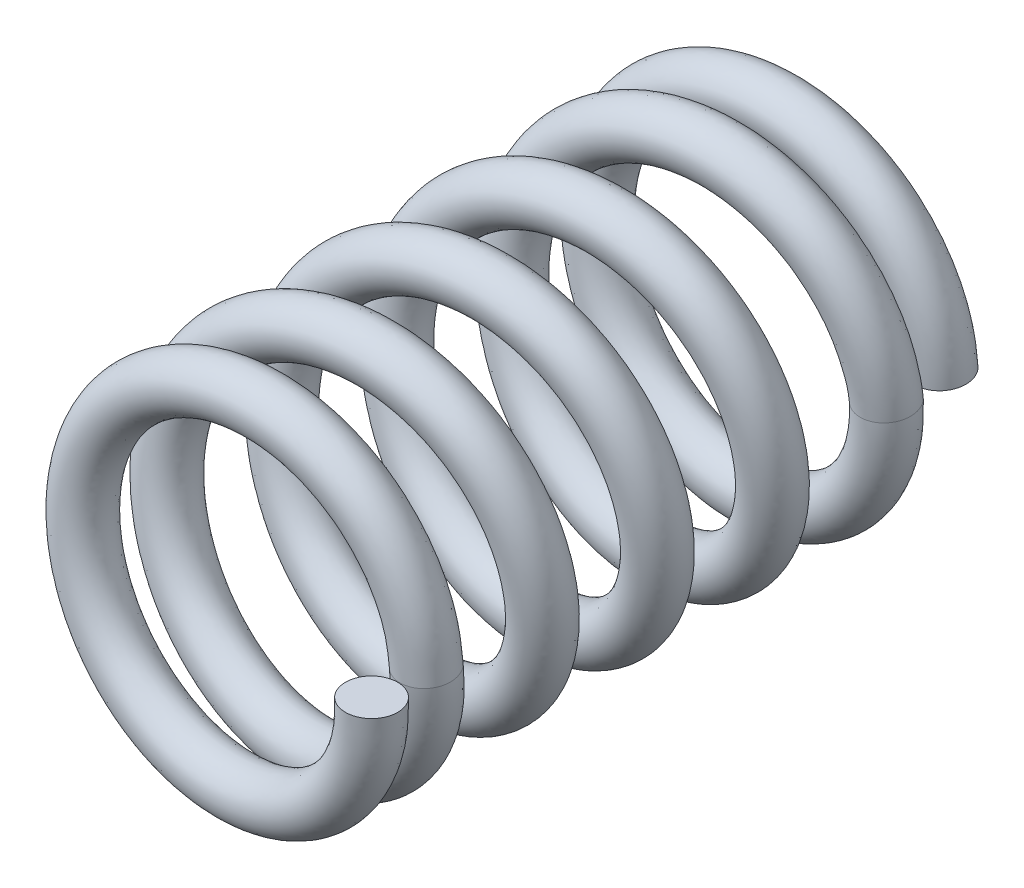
ISO-10303-21;
HEADER;
FILE_DESCRIPTION(('STEP AP214'),'2;1');
FILE_NAME('part.step','',(''),(''),'','','');
FILE_SCHEMA(('AUTOMOTIVE_DESIGN { 1 0 10303 214 1 1 1 1 }'));
ENDSEC;
DATA;
#1=APPLICATION_CONTEXT('core data for automotive mechanical design processes');
#2=APPLICATION_PROTOCOL_DEFINITION('international standard','automotive_design',2000,#1);
#3=PRODUCT_CONTEXT('',#1,'mechanical');
#4=PRODUCT('Part','Part','',(#3));
#5=PRODUCT_RELATED_PRODUCT_CATEGORY('part','',(#4));
#6=PRODUCT_DEFINITION_FORMATION('','',#4);
#7=PRODUCT_DEFINITION_CONTEXT('part definition',#1,'design');
#8=PRODUCT_DEFINITION('design','',#6,#7);
#9=PRODUCT_DEFINITION_SHAPE('','',#8);
#10=(LENGTH_UNIT() NAMED_UNIT(*) SI_UNIT(.MILLI.,.METRE.));
#11=(NAMED_UNIT(*) PLANE_ANGLE_UNIT() SI_UNIT($,.RADIAN.));
#12=(NAMED_UNIT(*) SI_UNIT($,.STERADIAN.) SOLID_ANGLE_UNIT());
#13=UNCERTAINTY_MEASURE_WITH_UNIT(LENGTH_MEASURE(1.E-05),#10,'distance_accuracy_value','');
#14=(GEOMETRIC_REPRESENTATION_CONTEXT(3) GLOBAL_UNCERTAINTY_ASSIGNED_CONTEXT((#13)) GLOBAL_UNIT_ASSIGNED_CONTEXT((#10,
#11,#12)) REPRESENTATION_CONTEXT('',''));
#15=CARTESIAN_POINT('',(0.,0.,0.));
#16=DIRECTION('',(0.,0.,1.));
#17=DIRECTION('',(1.,0.,0.));
#18=AXIS2_PLACEMENT_3D('',#15,#16,#17);
#19=CARTESIAN_POINT('',(1.6129,0.,0.2667));
#20=CARTESIAN_POINT('',(1.60678015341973,-0.105313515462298,0.260887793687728));
#21=CARTESIAN_POINT('',(1.59451172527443,-0.316435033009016,0.249236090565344));
#22=CARTESIAN_POINT('',(1.49919636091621,-0.621162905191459,0.231826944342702));
#23=CARTESIAN_POINT('',(1.34983107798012,-0.901915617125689,0.214338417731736));
#24=CARTESIAN_POINT('',(1.12555376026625,-1.17505417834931,0.194910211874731));
#25=CARTESIAN_POINT('',(0.815617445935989,-1.41271037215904,0.173564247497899));
#26=CARTESIAN_POINT('',(0.422242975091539,-1.57578980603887,0.150324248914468));
#27=CARTESIAN_POINT('',(-1.04437313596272E-05,-1.63150423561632,0.127006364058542));
#28=CARTESIAN_POINT('',(-0.422209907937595,-1.5756943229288,0.103716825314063));
#29=CARTESIAN_POINT('',(-0.815663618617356,-1.41279096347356,0.0804648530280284));
#30=CARTESIAN_POINT('',(-1.15366181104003,-1.15365096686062,0.0571638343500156));
#31=CARTESIAN_POINT('',(-1.41273557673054,-0.815635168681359,0.0338658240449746));
#32=CARTESIAN_POINT('',(-1.57575155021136,-0.42223325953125,0.0106138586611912));
#33=CARTESIAN_POINT('',(-1.63151808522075,7.91330951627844E-06,-0.0126852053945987));
#34=CARTESIAN_POINT('',(-1.57569587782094,0.422213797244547,-0.0359843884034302));
#35=CARTESIAN_POINT('',(-1.412788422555,0.81566046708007,-0.0592363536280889));
#36=CARTESIAN_POINT('',(-1.15365209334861,1.15366352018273,-0.0825342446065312));
#37=CARTESIAN_POINT('',(-0.815636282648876,1.41273588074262,-0.105835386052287));
#38=CARTESIAN_POINT('',(-0.422230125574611,1.57574830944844,-0.129087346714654));
#39=CARTESIAN_POINT('',(5.87756188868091E-06,1.63152255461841,-0.152376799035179));
#40=CARTESIAN_POINT('',(0.422217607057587,1.57570109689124,-0.175694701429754));
#41=CARTESIAN_POINT('',(0.815649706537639,1.41281066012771,-0.198935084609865));
#42=CARTESIAN_POINT('',(1.12558747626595,1.17495815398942,-0.22027957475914));
#43=CARTESIAN_POINT('',(1.34979193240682,0.902208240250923,-0.239711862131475));
#44=CARTESIAN_POINT('',(1.49917147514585,0.619952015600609,-0.257186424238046));
#45=CARTESIAN_POINT('',(1.5948415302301,0.320021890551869,-0.274698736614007));
#46=CARTESIAN_POINT('',(1.6068920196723,0.0937864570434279,-0.286271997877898));
#47=CARTESIAN_POINT('',(1.61292961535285,-0.019563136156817,-0.292070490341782));
#48=CARTESIAN_POINT('',(2.1463,0.,0.2667));
#49=CARTESIAN_POINT('',(2.13817127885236,-0.140255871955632,0.260891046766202));
#50=CARTESIAN_POINT('',(2.12187566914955,-0.421426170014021,0.249245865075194));
#51=CARTESIAN_POINT('',(1.99520932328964,-0.825893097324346,0.231769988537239));
#52=CARTESIAN_POINT('',(1.79620325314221,-1.20036652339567,0.214262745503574));
#53=CARTESIAN_POINT('',(1.49745984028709,-1.56385699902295,0.194919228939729));
#54=CARTESIAN_POINT('',(1.08601977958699,-1.87961038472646,0.173606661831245));
#55=CARTESIAN_POINT('',(0.561391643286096,-2.09713120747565,0.15021230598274));
#56=CARTESIAN_POINT('',(-3.62346147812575E-05,-2.17094270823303,0.126992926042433));
#57=CARTESIAN_POINT('',(-0.561368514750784,-2.09700935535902,0.103744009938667));
#58=CARTESIAN_POINT('',(-1.08587445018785,-1.87982550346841,0.0803750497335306));
#59=CARTESIAN_POINT('',(-1.53510805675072,-1.53509835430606,0.0571363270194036));
#60=CARTESIAN_POINT('',(-1.87976956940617,-1.08584479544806,0.0338935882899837));
#61=CARTESIAN_POINT('',(-2.09706058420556,-0.561412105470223,0.0105266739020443));
#62=CARTESIAN_POINT('',(-2.17096592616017,6.26488792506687E-06,-0.0127147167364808));
#63=CARTESIAN_POINT('',(-2.09700562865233,0.561390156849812,-0.0359562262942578));
#64=CARTESIAN_POINT('',(-1.87982366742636,1.08586782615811,-0.0593231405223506));
#65=CARTESIAN_POINT('',(-1.53510067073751,1.53510857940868,-0.0825657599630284));
#66=CARTESIAN_POINT('',(-1.08584937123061,1.8797691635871,-0.105804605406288));
#67=CARTESIAN_POINT('',(-0.561391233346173,2.09706265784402,-0.129173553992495));
#68=CARTESIAN_POINT('',(-2.31986155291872E-05,2.1709608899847,-0.1524223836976));
#69=CARTESIAN_POINT('',(0.561363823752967,2.09704372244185,-0.175641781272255));
#70=CARTESIAN_POINT('',(1.08604973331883,1.879710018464,-0.199036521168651));
#71=CARTESIAN_POINT('',(1.49749118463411,1.56376966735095,-0.22034761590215));
#72=CARTESIAN_POINT('',(1.79616301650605,1.20064361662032,-0.23969520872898));
#73=CARTESIAN_POINT('',(1.99518210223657,0.824751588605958,-0.257188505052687));
#74=CARTESIAN_POINT('',(2.12230107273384,0.424473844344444,-0.274767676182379));
#75=CARTESIAN_POINT('',(2.13830916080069,0.128654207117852,-0.286334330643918));
#76=CARTESIAN_POINT('',(2.14632961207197,-0.0195588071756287,-0.292129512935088));
#77=CARTESIAN_POINT('',(2.1463,0.,-0.2667));
#78=CARTESIAN_POINT('',(2.13817388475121,-0.140258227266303,-0.27250895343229));
#79=CARTESIAN_POINT('',(2.12188349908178,-0.421433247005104,-0.284154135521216));
#80=CARTESIAN_POINT('',(1.99516031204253,-0.82586225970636,-0.30163000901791));
#81=CARTESIAN_POINT('',(1.796137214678,-1.2003290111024,-0.319137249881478));
#82=CARTESIAN_POINT('',(1.49747296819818,-1.56385606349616,-0.338480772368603));
#83=CARTESIAN_POINT('',(1.08603542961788,-1.87965107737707,-0.359793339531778));
#84=CARTESIAN_POINT('',(0.561356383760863,-2.09702346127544,-0.383187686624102));
#85=CARTESIAN_POINT('',(-1.99338580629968E-05,-2.17092866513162,-0.406407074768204));
#86=CARTESIAN_POINT('',(-0.561383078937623,-2.09703476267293,-0.429655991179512));
#87=CARTESIAN_POINT('',(-1.08583396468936,-1.87974320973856,-0.453024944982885));
#88=CARTESIAN_POINT('',(-1.53507722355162,-1.5350898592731,-0.476263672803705));
#89=CARTESIAN_POINT('',(-1.879797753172,-1.08585336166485,-0.49950641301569));
#90=CARTESIAN_POINT('',(-2.0969764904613,-0.561382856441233,-0.522873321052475));
#91=CARTESIAN_POINT('',(-2.17093608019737,-9.57481690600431E-06,-0.546114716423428));
#92=CARTESIAN_POINT('',(-2.09703203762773,0.561404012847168,-0.569356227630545));
#93=CARTESIAN_POINT('',(-1.87974380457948,1.08582933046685,-0.592723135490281));
#94=CARTESIAN_POINT('',(-1.53508929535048,1.53507497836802,-0.615965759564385));
#95=CARTESIAN_POINT('',(-1.08585995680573,1.87979935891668,-0.639204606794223));
#96=CARTESIAN_POINT('',(-0.561361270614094,2.09698112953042,-0.662573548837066));
#97=CARTESIAN_POINT('',(-3.94962849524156E-05,2.1709093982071,-0.685822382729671));
#98=CARTESIAN_POINT('',(0.561383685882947,2.09711558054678,-0.709041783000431));
#99=CARTESIAN_POINT('',(1.08600416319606,1.87953633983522,-0.732436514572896));
#100=CARTESIAN_POINT('',(1.49743690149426,1.56399935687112,-0.753747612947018));
#101=CARTESIAN_POINT('',(1.79617966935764,1.19991123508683,-0.773095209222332));
#102=CARTESIAN_POINT('',(1.99517620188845,0.82754085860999,-0.790588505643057));
#103=CARTESIAN_POINT('',(2.12223480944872,0.414019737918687,-0.808167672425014));
#104=CARTESIAN_POINT('',(2.13824758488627,0.151228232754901,-0.819734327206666));
#105=CARTESIAN_POINT('',(2.14627038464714,0.0195631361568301,-0.825529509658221));
#106=CARTESIAN_POINT('',(1.6129,0.,-0.2667));
#107=CARTESIAN_POINT('',(1.60678275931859,-0.105315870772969,-0.272512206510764));
#108=CARTESIAN_POINT('',(1.59451955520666,-0.316442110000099,-0.284163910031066));
#109=CARTESIAN_POINT('',(1.4991473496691,-0.621132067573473,-0.301573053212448));
#110=CARTESIAN_POINT('',(1.34976503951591,-0.901878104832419,-0.319061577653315));
#111=CARTESIAN_POINT('',(1.12556688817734,-1.17505324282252,-0.338489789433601));
#112=CARTESIAN_POINT('',(0.815633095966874,-1.41275106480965,-0.359835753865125));
#113=CARTESIAN_POINT('',(0.422207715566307,-1.57568205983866,-0.383075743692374));
#114=CARTESIAN_POINT('',(5.85702535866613E-06,-1.6314901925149,-0.406393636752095));
#115=CARTESIAN_POINT('',(-0.422224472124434,-1.57571973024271,-0.429683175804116));
#116=CARTESIAN_POINT('',(-0.81562313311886,-1.41270866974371,-0.452935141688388));
#117=CARTESIAN_POINT('',(-1.15363097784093,-1.15364247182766,-0.476236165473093));
#118=CARTESIAN_POINT('',(-1.41276376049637,-0.815643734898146,-0.499534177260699));
#119=CARTESIAN_POINT('',(-1.5756674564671,-0.422204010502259,-0.522786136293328));
#120=CARTESIAN_POINT('',(-1.63148823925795,-7.92639531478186E-06,-0.546085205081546));
#121=CARTESIAN_POINT('',(-1.57572228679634,0.422227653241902,-0.569384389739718));
#122=CARTESIAN_POINT('',(-1.41270855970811,0.815621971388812,-0.59263634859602));
#123=CARTESIAN_POINT('',(-1.15364071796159,1.15362991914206,-0.615934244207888));
#124=CARTESIAN_POINT('',(-0.815646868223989,1.41276607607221,-0.639235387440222));
#125=CARTESIAN_POINT('',(-0.422200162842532,1.57566678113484,-0.662487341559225));
#126=CARTESIAN_POINT('',(-1.04201075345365E-05,1.63147106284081,-0.685776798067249));
#127=CARTESIAN_POINT('',(0.422237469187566,1.57577295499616,-0.709094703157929));
#128=CARTESIAN_POINT('',(0.81560413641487,1.41263698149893,-0.73233507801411));
#129=CARTESIAN_POINT('',(1.1255331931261,1.17518784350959,-0.753679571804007));
#130=CARTESIAN_POINT('',(1.3498085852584,0.901475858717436,-0.773111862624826));
#131=CARTESIAN_POINT('',(1.49916557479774,0.622741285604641,-0.790586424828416));
#132=CARTESIAN_POINT('',(1.59477526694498,0.30956778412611,-0.808098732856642));
#133=CARTESIAN_POINT('',(1.60683044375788,0.116360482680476,-0.819671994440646));
#134=CARTESIAN_POINT('',(1.61287038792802,0.0195588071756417,-0.825470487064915));
#135=CARTESIAN_POINT('',(1.0795,0.,-0.2667));
#136=CARTESIAN_POINT('',(1.07539163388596,-0.0703735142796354,-0.272515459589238));
#137=CARTESIAN_POINT('',(1.06715561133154,-0.211450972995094,-0.284173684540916));
#138=CARTESIAN_POINT('',(1.00313438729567,-0.416401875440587,-0.301516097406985));
#139=CARTESIAN_POINT('',(0.903392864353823,-0.603427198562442,-0.318985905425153));
#140=CARTESIAN_POINT('',(0.753660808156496,-0.78625042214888,-0.338498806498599));
#141=CARTESIAN_POINT('',(0.54523076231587,-0.945851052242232,-0.359878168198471));
#142=CARTESIAN_POINT('',(0.28305904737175,-1.05434065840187,-0.382963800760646));
#143=CARTESIAN_POINT('',(3.16479087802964E-05,-1.09205171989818,-0.406380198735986));
#144=CARTESIAN_POINT('',(-0.283065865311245,-1.05440469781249,-0.42971036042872));
#145=CARTESIAN_POINT('',(-0.545412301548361,-0.945674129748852,-0.45284533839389));
#146=CARTESIAN_POINT('',(-0.772184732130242,-0.772195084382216,-0.476208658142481));
#147=CARTESIAN_POINT('',(-0.945729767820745,-0.545434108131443,-0.499561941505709));
#148=CARTESIAN_POINT('',(-1.05435842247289,-0.283025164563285,-0.522698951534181));
#149=CARTESIAN_POINT('',(-1.09204039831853,-6.27797372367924E-06,-0.546055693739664));
#150=CARTESIAN_POINT('',(-1.05441253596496,0.283051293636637,-0.56941255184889));
#151=CARTESIAN_POINT('',(-0.94567331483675,0.545414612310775,-0.592549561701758));
#152=CARTESIAN_POINT('',(-0.772192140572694,0.772184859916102,-0.615902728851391));
#153=CARTESIAN_POINT('',(-0.545433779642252,0.945732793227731,-0.639266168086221));
#154=CARTESIAN_POINT('',(-0.28303905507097,1.05435243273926,-0.662401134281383));
#155=CARTESIAN_POINT('',(1.86560698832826E-05,1.09203272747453,-0.685731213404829));
#156=CARTESIAN_POINT('',(0.283091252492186,1.05443032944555,-0.709147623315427));
#157=CARTESIAN_POINT('',(0.545204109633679,0.94573762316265,-0.732233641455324));
#158=CARTESIAN_POINT('',(0.753629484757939,0.78637633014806,-0.753611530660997));
#159=CARTESIAN_POINT('',(0.903437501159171,0.603040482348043,-0.77312851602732));
#160=CARTESIAN_POINT('',(1.00315494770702,0.417941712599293,-0.790584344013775));
#161=CARTESIAN_POINT('',(1.06731572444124,0.205115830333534,-0.808029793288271));
#162=CARTESIAN_POINT('',(1.07541330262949,0.0814927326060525,-0.819609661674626));
#163=CARTESIAN_POINT('',(1.07947039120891,0.0195544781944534,-0.825411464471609));
#164=CARTESIAN_POINT('',(1.0795,0.,0.2667));
#165=CARTESIAN_POINT('',(1.07538902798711,-0.0703711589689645,0.260884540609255));
#166=CARTESIAN_POINT('',(1.0671477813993,-0.211443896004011,0.249226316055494));
#167=CARTESIAN_POINT('',(1.00318339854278,-0.416432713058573,0.231883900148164));
#168=CARTESIAN_POINT('',(0.903458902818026,-0.603464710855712,0.214414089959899));
#169=CARTESIAN_POINT('',(0.753647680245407,-0.786251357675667,0.194901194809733));
#170=CARTESIAN_POINT('',(0.545215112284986,-0.945810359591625,0.173521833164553));
#171=CARTESIAN_POINT('',(0.283094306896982,-1.05444840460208,0.150436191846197));
#172=CARTESIAN_POINT('',(1.53471520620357E-05,-1.0920657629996,0.127019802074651));
#173=CARTESIAN_POINT('',(-0.283051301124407,-1.05437929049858,0.103689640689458));
#174=CARTESIAN_POINT('',(-0.545452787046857,-0.945756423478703,0.0805546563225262));
#175=CARTESIAN_POINT('',(-0.772215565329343,-0.772203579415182,0.0571913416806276));
#176=CARTESIAN_POINT('',(-0.945701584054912,-0.545425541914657,0.0338380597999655));
#177=CARTESIAN_POINT('',(-1.05444251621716,-0.283054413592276,0.0107010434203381));
#178=CARTESIAN_POINT('',(-1.09207024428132,9.56173110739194E-06,-0.0126556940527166));
#179=CARTESIAN_POINT('',(-1.05438612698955,0.283037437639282,-0.0360125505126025));
#180=CARTESIAN_POINT('',(-0.945753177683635,0.545453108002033,-0.0591495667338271));
#181=CARTESIAN_POINT('',(-0.77220351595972,0.772218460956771,-0.0825027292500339));
#182=CARTESIAN_POINT('',(-0.54542319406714,0.945702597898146,-0.105866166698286));
#183=CARTESIAN_POINT('',(-0.283069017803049,1.05443396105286,-0.129001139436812));
#184=CARTESIAN_POINT('',(3.49537393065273E-05,1.09208421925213,-0.152331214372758));
#185=CARTESIAN_POINT('',(0.283071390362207,1.05435847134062,-0.175747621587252));
#186=CARTESIAN_POINT('',(0.545249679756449,0.945911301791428,-0.198833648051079));
#187=CARTESIAN_POINT('',(0.753683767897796,0.786146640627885,-0.220211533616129));
#188=CARTESIAN_POINT('',(0.903420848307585,0.60377286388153,-0.239728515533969));
#189=CARTESIAN_POINT('',(1.00316084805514,0.415152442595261,-0.257184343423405));
#190=CARTESIAN_POINT('',(1.06738198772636,0.215569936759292,-0.274629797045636));
#191=CARTESIAN_POINT('',(1.07547487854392,0.0589187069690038,-0.286209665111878));
#192=CARTESIAN_POINT('',(1.07952961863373,-0.0195674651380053,-0.292011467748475));
#193=CARTESIAN_POINT('',(1.6129,0.,0.2667));
#194=CARTESIAN_POINT('',(1.60678015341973,-0.105313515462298,0.260887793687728));
#195=CARTESIAN_POINT('',(1.59451172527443,-0.316435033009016,0.249236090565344));
#196=CARTESIAN_POINT('',(1.49919636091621,-0.621162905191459,0.231826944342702));
#197=CARTESIAN_POINT('',(1.34983107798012,-0.901915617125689,0.214338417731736));
#198=CARTESIAN_POINT('',(1.12555376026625,-1.17505417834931,0.194910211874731));
#199=CARTESIAN_POINT('',(0.815617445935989,-1.41271037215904,0.173564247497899));
#200=CARTESIAN_POINT('',(0.422242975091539,-1.57578980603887,0.150324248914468));
#201=CARTESIAN_POINT('',(-1.04437313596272E-05,-1.63150423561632,0.127006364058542));
#202=CARTESIAN_POINT('',(-0.422209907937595,-1.5756943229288,0.103716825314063));
#203=CARTESIAN_POINT('',(-0.815663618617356,-1.41279096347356,0.0804648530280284));
#204=CARTESIAN_POINT('',(-1.15366181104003,-1.15365096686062,0.0571638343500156));
#205=CARTESIAN_POINT('',(-1.41273557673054,-0.815635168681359,0.0338658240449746));
#206=CARTESIAN_POINT('',(-1.57575155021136,-0.42223325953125,0.0106138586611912));
#207=CARTESIAN_POINT('',(-1.63151808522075,7.91330951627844E-06,-0.0126852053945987));
#208=CARTESIAN_POINT('',(-1.57569587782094,0.422213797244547,-0.0359843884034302));
#209=CARTESIAN_POINT('',(-1.412788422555,0.81566046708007,-0.0592363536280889));
#210=CARTESIAN_POINT('',(-1.15365209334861,1.15366352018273,-0.0825342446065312));
#211=CARTESIAN_POINT('',(-0.815636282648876,1.41273588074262,-0.105835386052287));
#212=CARTESIAN_POINT('',(-0.422230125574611,1.57574830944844,-0.129087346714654));
#213=CARTESIAN_POINT('',(5.87756188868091E-06,1.63152255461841,-0.152376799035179));
#214=CARTESIAN_POINT('',(0.422217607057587,1.57570109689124,-0.175694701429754));
#215=CARTESIAN_POINT('',(0.815649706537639,1.41281066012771,-0.198935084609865));
#216=CARTESIAN_POINT('',(1.12558747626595,1.17495815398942,-0.22027957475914));
#217=CARTESIAN_POINT('',(1.34979193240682,0.902208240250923,-0.239711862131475));
#218=CARTESIAN_POINT('',(1.49917147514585,0.619952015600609,-0.257186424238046));
#219=CARTESIAN_POINT('',(1.5948415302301,0.320021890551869,-0.274698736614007));
#220=CARTESIAN_POINT('',(1.6068920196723,0.0937864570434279,-0.286271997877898));
#221=CARTESIAN_POINT('',(1.61292961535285,-0.019563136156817,-0.292070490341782));
#222=(BOUNDED_SURFACE() B_SPLINE_SURFACE(3,3,((#19,#20,#21,#22,#23,#24,#25,#26,#27,#28,#29,#30,
#31,#32,#33,#34,#35,#36,#37,#38,#39,#40,#41,#42,#43,#44,#45,#46,#47),(#48,#49,#50,#51,#52,#53,
#54,#55,#56,#57,#58,#59,#60,#61,#62,#63,#64,#65,#66,#67,#68,#69,#70,#71,#72,#73,#74,#75,#76),
(#77,#78,#79,#80,#81,#82,#83,#84,#85,#86,#87,#88,#89,#90,#91,#92,#93,#94,#95,#96,#97,#98,#99,
#100,#101,#102,#103,#104,#105),(#106,#107,#108,#109,#110,#111,#112,#113,#114,#115,#116,#117,
#118,#119,#120,#121,#122,#123,#124,#125,#126,#127,#128,#129,#130,#131,#132,#133,#134),(#135,
#136,#137,#138,#139,#140,#141,#142,#143,#144,#145,#146,#147,#148,#149,#150,#151,#152,#153,#154,
#155,#156,#157,#158,#159,#160,#161,#162,#163),(#164,#165,#166,#167,#168,#169,#170,#171,#172,
#173,#174,#175,#176,#177,#178,#179,#180,#181,#182,#183,#184,#185,#186,#187,#188,#189,#190,#191,
#192),(#193,#194,#195,#196,#197,#198,#199,#200,#201,#202,#203,#204,#205,#206,#207,#208,#209,
#210,#211,#212,#213,#214,#215,#216,#217,#218,#219,#220,#221)),.UNSPECIFIED.,.T.,.F.,
.F.) B_SPLINE_SURFACE_WITH_KNOTS((4,3,4),(4,1,1,1,1,1,1,1,1,1,1,1,1,1,1,1,1,1,1,1,1,1,1,1,1,1,
4),(0.,0.5,1.),(0.,0.0312044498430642,0.0625554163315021,0.0938220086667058,0.125073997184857,
0.166737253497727,0.208355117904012,0.25000783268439,0.291662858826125,0.333281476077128,
0.374935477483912,0.416589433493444,0.45820841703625,0.499862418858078,0.541516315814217,
0.583135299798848,0.624789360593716,0.666443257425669,0.708061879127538,0.749717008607,
0.791369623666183,0.832987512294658,0.874650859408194,0.905902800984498,0.93716946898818,
0.96852033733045,1.),
.UNSPECIFIED.) GEOMETRIC_REPRESENTATION_ITEM() RATIONAL_B_SPLINE_SURFACE(((1.,1.,1.,1.,1.,1.,1.,
1.,1.,1.,1.,1.,1.,1.,1.,1.,1.,1.,1.,1.,1.,1.,1.,1.,1.,1.,1.,1.,1.),(0.333333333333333,
0.333333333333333,0.333333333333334,0.333333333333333,0.333333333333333,0.333333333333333,
0.333333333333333,0.333333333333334,0.333333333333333,0.333333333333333,0.333333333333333,
0.333333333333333,0.333333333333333,0.333333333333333,0.333333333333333,0.333333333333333,
0.333333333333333,0.333333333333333,0.333333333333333,0.333333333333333,0.333333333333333,
0.333333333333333,0.333333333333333,0.333333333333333,0.333333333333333,0.333333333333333,
0.333333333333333,0.333333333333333,0.333333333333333),(0.333333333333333,0.333333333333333,
0.333333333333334,0.333333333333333,0.333333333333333,0.333333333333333,0.333333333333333,
0.333333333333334,0.333333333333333,0.333333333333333,0.333333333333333,0.333333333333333,
0.333333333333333,0.333333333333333,0.333333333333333,0.333333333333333,0.333333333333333,
0.333333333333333,0.333333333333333,0.333333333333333,0.333333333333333,0.333333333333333,
0.333333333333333,0.333333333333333,0.333333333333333,0.333333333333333,0.333333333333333,
0.333333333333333,0.333333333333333),(1.,1.,1.,1.,1.,1.,1.,1.,1.,1.,1.,1.,1.,1.,1.,1.,1.,1.,1.,
1.,1.,1.,1.,1.,1.,1.,1.,1.,1.),(0.333333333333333,0.333333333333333,0.333333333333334,
0.333333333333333,0.333333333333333,0.333333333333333,0.333333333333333,0.333333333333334,
0.333333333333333,0.333333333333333,0.333333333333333,0.333333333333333,0.333333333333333,
0.333333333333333,0.333333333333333,0.333333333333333,0.333333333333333,0.333333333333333,
0.333333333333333,0.333333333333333,0.333333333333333,0.333333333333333,0.333333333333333,
0.333333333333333,0.333333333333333,0.333333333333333,0.333333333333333,0.333333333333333,
0.333333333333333),(0.333333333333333,0.333333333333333,0.333333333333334,0.333333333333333,
0.333333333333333,0.333333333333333,0.333333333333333,0.333333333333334,0.333333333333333,
0.333333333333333,0.333333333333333,0.333333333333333,0.333333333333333,0.333333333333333,
0.333333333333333,0.333333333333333,0.333333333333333,0.333333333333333,0.333333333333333,
0.333333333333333,0.333333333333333,0.333333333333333,0.333333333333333,0.333333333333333,
0.333333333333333,0.333333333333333,0.333333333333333,0.333333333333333,0.333333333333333),(1.,
1.,1.,1.,1.,1.,1.,1.,1.,1.,1.,1.,1.,1.,1.,1.,1.,1.,1.,1.,1.,1.,1.,1.,1.,1.,1.,1.,1.))) REPRESENTATION_ITEM('') SURFACE());
#223=CARTESIAN_POINT('',(1.6129,0.,0.));
#224=DIRECTION('',(0.,1.,0.));
#225=DIRECTION('',(0.,0.,1.));
#226=AXIS2_PLACEMENT_3D('',#223,#224,#225);
#227=CIRCLE('',#226,0.2667);
#228=CARTESIAN_POINT('',(1.6129,0.,0.2667));
#229=VERTEX_POINT('',#228);
#230=EDGE_CURVE('E10',#229,#229,#227,.T.);
#231=CARTESIAN_POINT('',(1.61292961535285,-0.019563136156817,-0.292070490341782));
#232=CARTESIAN_POINT('',(2.14632961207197,-0.0195588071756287,-0.292129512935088));
#233=CARTESIAN_POINT('',(2.14627038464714,0.0195631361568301,-0.825529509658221));
#234=CARTESIAN_POINT('',(1.61287038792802,0.0195588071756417,-0.825470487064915));
#235=CARTESIAN_POINT('',(1.07947039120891,0.0195544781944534,-0.825411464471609));
#236=CARTESIAN_POINT('',(1.07952961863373,-0.0195674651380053,-0.292011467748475));
#237=CARTESIAN_POINT('',(1.61292961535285,-0.019563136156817,-0.292070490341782));
#238=(BOUNDED_CURVE() B_SPLINE_CURVE(3,(#231,#232,#233,#234,#235,#236,#237),.UNSPECIFIED.,.T.,
.F.) B_SPLINE_CURVE_WITH_KNOTS((4,3,4),(0.,0.5,1.),
.UNSPECIFIED.) CURVE() GEOMETRIC_REPRESENTATION_ITEM() RATIONAL_B_SPLINE_CURVE((1.,
0.333333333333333,0.333333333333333,1.,0.333333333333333,0.333333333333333,1.)) REPRESENTATION_ITEM(''));
#239=CARTESIAN_POINT('',(1.61292961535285,-0.019563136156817,-0.292070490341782));
#240=VERTEX_POINT('',#239);
#241=EDGE_CURVE('E44',#240,#240,#238,.F.);
#242=ORIENTED_EDGE('',*,*,#230,.F.);
#243=EDGE_LOOP('',(#242));
#244=FACE_BOUND('',#243,.T.);
#245=ORIENTED_EDGE('',*,*,#241,.F.);
#246=EDGE_LOOP('',(#245));
#247=FACE_BOUND('',#246,.T.);
#248=ADVANCED_FACE('F36',(#244,#247),#222,.F.);
#249=CARTESIAN_POINT('',(1.6129,0.,0.));
#250=DIRECTION('',(0.,1.,0.));
#251=DIRECTION('',(0.,0.,1.));
#252=AXIS2_PLACEMENT_3D('',#249,#250,#251);
#253=PLANE('',#252);
#254=ORIENTED_EDGE('',*,*,#230,.T.);
#255=EDGE_LOOP('',(#254));
#256=FACE_BOUND('',#255,.T.);
#257=ADVANCED_FACE('F87',(#256),#253,.T.);
#258=CARTESIAN_POINT('',(1.61292961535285,-0.019563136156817,-0.292070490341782));
#259=CARTESIAN_POINT('',(1.61292961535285,-0.124929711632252,-0.302551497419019));
#260=CARTESIAN_POINT('',(1.58580426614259,-0.345125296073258,-0.330524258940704));
#261=CARTESIAN_POINT('',(1.49005825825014,-0.6450528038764,-0.3657809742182));
#262=CARTESIAN_POINT('',(1.33482287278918,-0.924303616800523,-0.402912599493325));
#263=CARTESIAN_POINT('',(1.10637445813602,-1.19345196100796,-0.443649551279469));
#264=CARTESIAN_POINT('',(0.792433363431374,-1.42615182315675,-0.488562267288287));
#265=CARTESIAN_POINT('',(0.39640158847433,-1.58277806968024,-0.537409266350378));
#266=CARTESIAN_POINT('',(-0.0267842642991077,-1.63154142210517,-0.586431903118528));
#267=CARTESIAN_POINT('',(-0.448071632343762,-1.56880592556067,-0.635391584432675));
#268=CARTESIAN_POINT('',(-0.838879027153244,-1.39945238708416,-0.684274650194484));
#269=CARTESIAN_POINT('',(-1.17262549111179,-1.13475005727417,-0.733259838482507));
#270=CARTESIAN_POINT('',(-1.42615132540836,-0.792476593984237,-0.782237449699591));
#271=CARTESIAN_POINT('',(-1.58273405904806,-0.396386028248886,-0.831120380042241));
#272=CARTESIAN_POINT('',(-1.63156349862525,0.0267825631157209,-0.880101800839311));
#273=CARTESIAN_POINT('',(-1.5688065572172,0.448075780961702,-0.92908144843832));
#274=CARTESIAN_POINT('',(-1.39944911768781,0.838874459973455,-0.977964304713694));
#275=CARTESIAN_POINT('',(-1.13475156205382,1.17262792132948,-1.02694539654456));
#276=CARTESIAN_POINT('',(-0.792476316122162,1.42615114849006,-1.07592522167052));
#277=CARTESIAN_POINT('',(-0.396386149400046,1.58273377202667,-1.1248080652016));
#278=CARTESIAN_POINT('',(0.0267826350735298,1.63156368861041,-1.17378913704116));
#279=CARTESIAN_POINT('',(0.448075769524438,1.5688065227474,-1.22276897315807));
#280=CARTESIAN_POINT('',(0.838874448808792,1.39944911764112,-1.27165181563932));
#281=CARTESIAN_POINT('',(1.17262793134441,1.13475156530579,-1.32063288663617));
#282=CARTESIAN_POINT('',(1.4261511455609,0.792476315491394,-1.3696127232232));
#283=CARTESIAN_POINT('',(1.58273377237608,0.396386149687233,-1.41849556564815));
#284=CARTESIAN_POINT('',(1.63156368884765,-0.0267826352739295,-1.46747663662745));
#285=CARTESIAN_POINT('',(1.56880652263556,-0.448075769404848,-1.5164564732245));
#286=CARTESIAN_POINT('',(1.39944911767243,-0.838874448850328,-1.56533931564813));
#287=CARTESIAN_POINT('',(1.13475156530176,-1.17262793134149,-1.61432038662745));
#288=CARTESIAN_POINT('',(0.792476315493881,-1.42615114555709,-1.66330022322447));
#289=CARTESIAN_POINT('',(0.396386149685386,-1.58273377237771,-1.71218306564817));
#290=CARTESIAN_POINT('',(-0.026782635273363,-1.63156368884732,-1.76116413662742));
#291=CARTESIAN_POINT('',(-0.44807576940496,-1.56880652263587,-1.81014397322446));
#292=CARTESIAN_POINT('',(-0.838874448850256,-1.39944911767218,-1.85902681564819));
#293=CARTESIAN_POINT('',(-1.17262793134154,-1.13475156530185,-1.9080078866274));
#294=CARTESIAN_POINT('',(-1.42615114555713,-0.792476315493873,-1.95698772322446));
#295=CARTESIAN_POINT('',(-1.58273377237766,-0.396386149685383,-2.00587056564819));
#296=CARTESIAN_POINT('',(-1.63156368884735,0.0267826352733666,-2.05485163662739));
#297=CARTESIAN_POINT('',(-1.56880652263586,0.448075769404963,-2.10383147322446));
#298=CARTESIAN_POINT('',(-1.39944911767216,0.838874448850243,-2.1527143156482));
#299=CARTESIAN_POINT('',(-1.13475156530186,1.17262793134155,-2.20169538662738));
#300=CARTESIAN_POINT('',(-0.792476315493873,1.42615114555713,-2.25067522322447));
#301=CARTESIAN_POINT('',(-0.396386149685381,1.58273377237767,-2.29955806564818));
#302=CARTESIAN_POINT('',(0.0267826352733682,1.63156368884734,-2.3485391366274));
#303=CARTESIAN_POINT('',(0.448075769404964,1.56880652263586,-2.39751897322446));
#304=CARTESIAN_POINT('',(0.838874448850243,1.39944911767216,-2.4464018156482));
#305=CARTESIAN_POINT('',(1.17262793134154,1.13475156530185,-2.49538288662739));
#306=CARTESIAN_POINT('',(1.42615114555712,0.792476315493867,-2.54436272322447));
#307=CARTESIAN_POINT('',(1.58273377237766,0.396386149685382,-2.59324556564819));
#308=CARTESIAN_POINT('',(1.63156368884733,-0.0267826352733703,-2.64222663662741));
#309=CARTESIAN_POINT('',(1.56880652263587,-0.448075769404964,-2.69120647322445));
#310=CARTESIAN_POINT('',(1.39944911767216,-0.838874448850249,-2.74008931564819));
#311=CARTESIAN_POINT('',(1.13475156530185,-1.17262793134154,-2.78907038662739));
#312=CARTESIAN_POINT('',(0.792476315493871,-1.42615114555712,-2.83805022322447));
#313=CARTESIAN_POINT('',(0.396386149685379,-1.58273377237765,-2.8869330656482));
#314=CARTESIAN_POINT('',(-0.0267826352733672,-1.63156368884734,-2.93591413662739));
#315=CARTESIAN_POINT('',(-0.448075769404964,-1.56880652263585,-2.98489397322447));
#316=CARTESIAN_POINT('',(-0.838874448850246,-1.39944911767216,-3.03377681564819));
#317=CARTESIAN_POINT('',(-1.17262793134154,-1.13475156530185,-3.08275788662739));
#318=CARTESIAN_POINT('',(-1.42615114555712,-0.792476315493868,-3.13173772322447));
#319=CARTESIAN_POINT('',(-1.58273377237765,-0.396386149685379,-3.18062056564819));
#320=CARTESIAN_POINT('',(-1.63156368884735,0.0267826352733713,-3.22960163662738));
#321=CARTESIAN_POINT('',(-1.56880652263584,0.448075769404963,-3.27858147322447));
#322=CARTESIAN_POINT('',(-1.39944911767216,0.838874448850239,-3.32746431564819));
#323=CARTESIAN_POINT('',(-1.13475156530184,1.17262793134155,-3.37644538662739));
#324=CARTESIAN_POINT('',(-0.792476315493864,1.42615114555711,-3.42542522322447));
#325=CARTESIAN_POINT('',(-0.396386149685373,1.58273377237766,-3.47430806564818));
#326=CARTESIAN_POINT('',(0.0267826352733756,1.63156368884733,-3.52328913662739));
#327=CARTESIAN_POINT('',(0.448075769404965,1.56880652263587,-3.57226897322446));
#328=CARTESIAN_POINT('',(0.838874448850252,1.39944911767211,-3.6211518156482));
#329=CARTESIAN_POINT('',(1.17262793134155,1.13475156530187,-3.67013288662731));
#330=CARTESIAN_POINT('',(1.42615114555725,0.792476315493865,-3.71911272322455));
#331=CARTESIAN_POINT('',(1.58273377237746,0.396386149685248,-3.76799556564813));
#332=CARTESIAN_POINT('',(1.63156368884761,-0.0267826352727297,-3.81697663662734));
#333=CARTESIAN_POINT('',(1.56880652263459,-0.448075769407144,-3.86595647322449));
#334=CARTESIAN_POINT('',(1.3994491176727,-0.838874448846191,-3.91483931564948));
#335=CARTESIAN_POINT('',(1.13475156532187,-1.17262793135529,-3.96382038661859));
#336=CARTESIAN_POINT('',(0.79247631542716,-1.42615114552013,-4.01280022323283));
#337=CARTESIAN_POINT('',(0.396386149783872,-1.58273377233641,-4.06168306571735));
#338=CARTESIAN_POINT('',(-0.0267826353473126,-1.63156368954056,-4.11066413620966));
#339=CARTESIAN_POINT('',(-0.448075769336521,-1.56880652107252,-4.15964397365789));
#340=CARTESIAN_POINT('',(-0.838874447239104,-1.39944911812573,-4.2085268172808));
#341=CARTESIAN_POINT('',(-1.17262794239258,-1.13475157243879,-4.25750787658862));
#342=CARTESIAN_POINT('',(-1.42615112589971,-0.792476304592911,-4.3064877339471));
#343=CARTESIAN_POINT('',(-1.58273375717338,-0.396386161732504,-4.35537059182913));
#344=CARTESIAN_POINT('',(-1.63156386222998,0.0267826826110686,-4.40435147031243));
#345=CARTESIAN_POINT('',(-1.56880632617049,0.448075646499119,-4.45333165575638));
#346=CARTESIAN_POINT('',(-1.39944895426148,0.838874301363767,-4.50221460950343));
#347=CARTESIAN_POINT('',(-1.13475234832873,1.17262942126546,-4.55119339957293));
#348=CARTESIAN_POINT('',(-0.792477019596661,1.42614982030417,-4.60017738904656));
#349=CARTESIAN_POINT('',(-0.396383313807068,1.58273061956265,-4.64906054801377));
#350=CARTESIAN_POINT('',(0.0267819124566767,1.63157378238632,-4.69802140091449));
#351=CARTESIAN_POINT('',(0.448078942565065,1.5688160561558,-4.74704157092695));
#352=CARTESIAN_POINT('',(0.838844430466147,1.39941202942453,-4.79589492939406));
#353=CARTESIAN_POINT('',(1.14498712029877,1.15673792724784,-4.84078831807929));
#354=CARTESIAN_POINT('',(1.36446572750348,0.879555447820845,-4.88157799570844));
#355=CARTESIAN_POINT('',(1.50991351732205,0.597323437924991,-4.91852367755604));
#356=CARTESIAN_POINT('',(1.59766970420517,0.287715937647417,-4.95441590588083));
#357=CARTESIAN_POINT('',(1.61299164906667,0.0857978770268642,-4.98052787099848));
#358=CARTESIAN_POINT('',(1.61299164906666,-0.0195676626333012,-4.99100877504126));
#359=CARTESIAN_POINT('',(1.07952961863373,-0.0195674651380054,-0.292011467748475));
#360=CARTESIAN_POINT('',(1.07952961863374,-0.118059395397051,-0.301808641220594));
#361=CARTESIAN_POINT('',(1.05933469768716,-0.227296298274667,-0.330806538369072));
#362=CARTESIAN_POINT('',(0.993795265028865,-0.443788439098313,-0.365517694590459));
#363=CARTESIAN_POINT('',(0.888505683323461,-0.624952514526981,-0.402719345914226));
#364=CARTESIAN_POINT('',(0.734437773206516,-0.804991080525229,-0.443600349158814));
#365=CARTESIAN_POINT('',(0.522041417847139,-0.959150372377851,-0.488594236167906));
#366=CARTESIAN_POINT('',(0.257228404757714,-1.06147079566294,-0.537116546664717));
#367=CARTESIAN_POINT('',(-0.0267668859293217,-1.09209376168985,-0.586344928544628));
#368=CARTESIAN_POINT('',(-0.308914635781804,-1.04749352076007,-0.635389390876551));
#369=CARTESIAN_POINT('',(-0.568686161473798,-0.932407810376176,-0.684028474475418));
#370=CARTESIAN_POINT('',(-0.791185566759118,-0.75329425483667,-0.733143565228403));
#371=CARTESIAN_POINT('',(-0.959118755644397,-0.522266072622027,-0.782236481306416));
#372=CARTESIAN_POINT('',(-1.06143097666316,-0.257188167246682,-0.83087956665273));
#373=CARTESIAN_POINT('',(-1.09211407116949,0.0267950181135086,-0.879981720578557));
#374=CARTESIAN_POINT('',(-1.04749727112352,0.308900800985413,-0.929080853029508));
#375=CARTESIAN_POINT('',(-0.932404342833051,0.568685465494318,-0.977723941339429));
#376=CARTESIAN_POINT('',(-0.753294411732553,0.791188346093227,-1.02682497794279));
#377=CARTESIAN_POINT('',(-0.522266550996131,0.95911825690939,-1.07592467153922));
#378=CARTESIAN_POINT('',(-0.257188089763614,1.06143077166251,-1.12456772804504));
#379=CARTESIAN_POINT('',(0.0267950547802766,1.09211424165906,-1.1736686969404));
#380=CARTESIAN_POINT('',(0.308900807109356,1.04749723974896,-1.22276842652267));
#381=CARTESIAN_POINT('',(0.568685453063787,0.932404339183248,-1.27141147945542));
#382=CARTESIAN_POINT('',(0.791188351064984,0.753294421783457,-1.32051244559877));
#383=CARTESIAN_POINT('',(0.959118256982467,0.52226654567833,-1.36961217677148));
#384=CARTESIAN_POINT('',(1.06143077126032,0.257188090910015,-1.4182552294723));
#385=CARTESIAN_POINT('',(1.0921142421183,-0.0267950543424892,-1.46735619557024));
#386=CARTESIAN_POINT('',(1.04749723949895,-0.308900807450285,-1.51645592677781));
#387=CARTESIAN_POINT('',(0.932404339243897,-0.568685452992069,-1.56509897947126));
#388=CARTESIAN_POINT('',(0.753294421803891,-0.791188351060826,-1.61419994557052));
#389=CARTESIAN_POINT('',(0.522266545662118,-0.959118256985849,-1.66329967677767));
#390=CARTESIAN_POINT('',(0.257188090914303,-1.06143077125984,-1.71194272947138));
#391=CARTESIAN_POINT('',(-0.0267950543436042,-1.09211424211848,-1.76104369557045));
#392=CARTESIAN_POINT('',(-0.308900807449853,-1.04749723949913,-1.81014342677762));
#393=CARTESIAN_POINT('',(-0.568685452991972,-0.932404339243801,-1.85878647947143));
#394=CARTESIAN_POINT('',(-0.791188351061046,-0.753294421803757,-1.90788744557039));
#395=CARTESIAN_POINT('',(-0.959118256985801,-0.52226654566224,-1.95698717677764));
#396=CARTESIAN_POINT('',(-1.06143077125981,-0.257188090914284,-2.00563022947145));
#397=CARTESIAN_POINT('',(-1.09211424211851,0.0267950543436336,-2.05473119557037));
#398=CARTESIAN_POINT('',(-1.04749723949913,0.30890080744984,-2.10383092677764));
#399=CARTESIAN_POINT('',(-0.932404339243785,0.568685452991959,-2.15247397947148));
#400=CARTESIAN_POINT('',(-0.753294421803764,0.791188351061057,-2.20157494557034));
#401=CARTESIAN_POINT('',(-0.522266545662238,0.959118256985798,-2.25067467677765));
#402=CARTESIAN_POINT('',(-0.257188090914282,1.06143077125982,-2.29931772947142));
#403=CARTESIAN_POINT('',(0.0267950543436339,1.0921142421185,-2.34841869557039));
#404=CARTESIAN_POINT('',(0.308900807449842,1.04749723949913,-2.39751842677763));
#405=CARTESIAN_POINT('',(0.568685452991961,0.932404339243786,-2.44616147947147));
#406=CARTESIAN_POINT('',(0.791188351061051,0.753294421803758,-2.49526244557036));
#407=CARTESIAN_POINT('',(0.959118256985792,0.522266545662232,-2.54436217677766));
#408=CARTESIAN_POINT('',(1.06143077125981,0.257188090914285,-2.59300522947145));
#409=CARTESIAN_POINT('',(1.09211424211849,-0.0267950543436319,-2.64210619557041));
#410=CARTESIAN_POINT('',(1.04749723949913,-0.308900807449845,-2.6912059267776));
#411=CARTESIAN_POINT('',(0.932404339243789,-0.568685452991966,-2.73984897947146));
#412=CARTESIAN_POINT('',(0.753294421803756,-0.791188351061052,-2.78894994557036));
#413=CARTESIAN_POINT('',(0.522266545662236,-0.959118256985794,-2.83804967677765));
#414=CARTESIAN_POINT('',(0.257188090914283,-1.0614307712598,-2.88669272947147));
#415=CARTESIAN_POINT('',(-0.0267950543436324,-1.0921142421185,-2.93579369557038));
#416=CARTESIAN_POINT('',(-0.30890080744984,-1.04749723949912,-2.98489342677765));
#417=CARTESIAN_POINT('',(-0.568685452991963,-0.932404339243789,-3.03353647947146));
#418=CARTESIAN_POINT('',(-0.791188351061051,-0.753294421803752,-3.08263744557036));
#419=CARTESIAN_POINT('',(-0.95911825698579,-0.522266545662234,-3.13173717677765));
#420=CARTESIAN_POINT('',(-1.0614307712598,-0.257188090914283,-3.18038022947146));
#421=CARTESIAN_POINT('',(-1.09211424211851,0.0267950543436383,-3.22948119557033));
#422=CARTESIAN_POINT('',(-1.0474972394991,0.308900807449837,-3.27858092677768));
#423=CARTESIAN_POINT('',(-0.932404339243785,0.568685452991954,-3.32722397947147));
#424=CARTESIAN_POINT('',(-0.753294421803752,0.791188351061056,-3.37632494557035));
#425=CARTESIAN_POINT('',(-0.522266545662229,0.959118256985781,-3.42542467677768));
#426=CARTESIAN_POINT('',(-0.25718809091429,1.06143077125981,-3.47406772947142));
#427=CARTESIAN_POINT('',(0.0267950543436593,1.0921142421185,-3.52316869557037));
#428=CARTESIAN_POINT('',(0.30890080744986,1.04749723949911,-3.57226842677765));
#429=CARTESIAN_POINT('',(0.568685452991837,0.93240433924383,-3.62091147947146));
#430=CARTESIAN_POINT('',(0.791188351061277,0.753294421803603,-3.67001244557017));
#431=CARTESIAN_POINT('',(0.95911825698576,0.522266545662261,-3.7191121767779));
#432=CARTESIAN_POINT('',(1.06143077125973,0.257188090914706,-3.76775522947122));
#433=CARTESIAN_POINT('',(1.09211424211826,-0.0267950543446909,-3.81685619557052));
#434=CARTESIAN_POINT('',(1.04749723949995,-0.308900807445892,-3.86595592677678));
#435=CARTESIAN_POINT('',(0.932404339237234,-0.568685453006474,-3.91459897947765));
#436=CARTESIAN_POINT('',(0.753294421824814,-0.791188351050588,-3.96369994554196));
#437=CARTESIAN_POINT('',(0.522266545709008,-0.959118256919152,-4.01279967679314));
#438=CARTESIAN_POINT('',(0.257188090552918,-1.06143077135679,-4.06144272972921));
#439=CARTESIAN_POINT('',(-0.0267950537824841,-1.09211424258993,-4.11054369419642));
#440=CARTESIAN_POINT('',(-0.308900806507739,-1.04749723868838,-4.1596434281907));
#441=CARTESIAN_POINT('',(-0.568685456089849,-0.932404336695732,-4.20828648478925));
#442=CARTESIAN_POINT('',(-0.791188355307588,-0.753294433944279,-4.25738741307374));
#443=CARTESIAN_POINT('',(-0.959118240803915,-0.522266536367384,-4.30648721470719));
#444=CARTESIAN_POINT('',(-1.06143075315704,-0.257188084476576,-4.35513030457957));
#445=CARTESIAN_POINT('',(-1.09211443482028,0.0267950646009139,-4.40423066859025));
#446=CARTESIAN_POINT('',(-1.04749696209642,0.308900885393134,-4.45333158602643));
#447=CARTESIAN_POINT('',(-0.932404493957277,0.568684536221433,-4.5019746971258));
#448=CARTESIAN_POINT('',(-0.753294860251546,0.791191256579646,-4.55106878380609));
#449=CARTESIAN_POINT('',(-0.522263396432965,0.959116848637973,-4.60018270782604));
#450=CARTESIAN_POINT('',(-0.257203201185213,1.06142552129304,-4.64882176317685));
#451=CARTESIAN_POINT('',(0.0268241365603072,1.09212233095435,-4.69786785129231));
#452=CARTESIAN_POINT('',(0.308928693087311,1.04751668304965,-4.7470920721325));
#453=CARTESIAN_POINT('',(0.568473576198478,0.932345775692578,-4.79562706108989));
#454=CARTESIAN_POINT('',(0.773067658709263,0.76843662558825,-4.8405799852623));
#455=CARTESIAN_POINT('',(0.918163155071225,0.57970585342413,-4.88157551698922));
#456=CARTESIAN_POINT('',(1.01365433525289,0.397843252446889,-4.91837567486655));
#457=CARTESIAN_POINT('',(1.07128798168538,0.162945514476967,-4.95453002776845));
#458=CARTESIAN_POINT('',(1.07959168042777,0.0926356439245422,-4.97966389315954));
#459=CARTESIAN_POINT('',(1.07959168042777,-0.0195810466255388,-4.99082629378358));
#460=CARTESIAN_POINT('',(1.07947039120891,0.0195544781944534,-0.825411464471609));
#461=CARTESIAN_POINT('',(1.07947039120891,-0.0789374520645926,-0.835208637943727));
#462=CARTESIAN_POINT('',(1.07130290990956,-0.168650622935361,-0.862196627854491));
#463=CARTESIAN_POINT('',(1.01352211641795,-0.396178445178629,-0.897712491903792));
#464=CARTESIAN_POINT('',(0.918042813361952,-0.58010624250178,-0.934703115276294));
#465=CARTESIAN_POINT('',(0.772956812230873,-0.768211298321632,-0.975643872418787));
#466=CARTESIAN_POINT('',(0.568380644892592,-0.932306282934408,-1.02061608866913));
#467=CARTESIAN_POINT('',(0.308861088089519,-1.04739487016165,-1.06914553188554));
#468=CARTESIAN_POINT('',(0.0267889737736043,-1.092003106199,-1.11837094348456));
#469=CARTESIAN_POINT('',(-0.257207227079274,-1.06129662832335,-1.16741695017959));
#470=CARTESIAN_POINT('',(-0.522233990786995,-0.958992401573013,-1.21605607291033));
#471=CARTESIAN_POINT('',(-0.753232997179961,-0.791079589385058,-1.26516968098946));
#472=CARTESIAN_POINT('',(-0.93231686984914,-0.568591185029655,-1.31426411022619));
#473=CARTESIAN_POINT('',(-1.04738798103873,-0.308833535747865,-1.36290716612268));
#474=CARTESIAN_POINT('',(-1.09199178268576,-0.0267598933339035,-1.41200780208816));
#475=CARTESIAN_POINT('',(-1.06130276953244,0.257192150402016,-1.46110850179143));
#476=CARTESIAN_POINT('',(-0.958993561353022,0.522237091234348,-1.50975153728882));
#477=CARTESIAN_POINT('',(-0.791076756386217,0.753232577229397,-1.5588510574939));
#478=CARTESIAN_POINT('',(-0.568592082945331,0.93231671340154,-1.60795232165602));
#479=CARTESIAN_POINT('',(-0.308833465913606,1.04738825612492,-1.65659532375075));
#480=CARTESIAN_POINT('',(-0.0267598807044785,1.09199159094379,-1.70569477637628));
#481=CARTESIAN_POINT('',(0.257192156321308,1.06130278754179,-1.75479607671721));
#482=CARTESIAN_POINT('',(0.522237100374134,0.958993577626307,-1.80343907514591));
#483=CARTESIAN_POINT('',(0.7532325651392,0.791076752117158,-1.85253852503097));
#484=CARTESIAN_POINT('',(0.932316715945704,0.568592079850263,-1.90163982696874));
#485=CARTESIAN_POINT('',(1.04738825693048,0.308833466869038,-1.95028282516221));
#486=CARTESIAN_POINT('',(1.09199159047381,0.0267598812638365,-1.99938227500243));
#487=CARTESIAN_POINT('',(1.06130278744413,-0.257192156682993,-2.0484835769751));
#488=CARTESIAN_POINT('',(0.958993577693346,-0.522237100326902,-2.09712657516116));
#489=CARTESIAN_POINT('',(0.791076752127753,-0.75323256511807,-2.1462260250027));
#490=CARTESIAN_POINT('',(0.568592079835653,-0.932316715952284,-2.19532732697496));
#491=CARTESIAN_POINT('',(0.308833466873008,-1.04738825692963,-2.24397032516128));
#492=CARTESIAN_POINT('',(0.0267598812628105,-1.09199159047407,-2.29306977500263));
#493=CARTESIAN_POINT('',(-0.257192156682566,-1.06130278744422,-2.34217107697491));
#494=CARTESIAN_POINT('',(-0.522237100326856,-0.958993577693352,-2.39081407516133));
#495=CARTESIAN_POINT('',(-0.75323256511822,-0.791076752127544,-2.43991352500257));
#496=CARTESIAN_POINT('',(-0.932316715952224,-0.568592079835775,-2.48901482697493));
#497=CARTESIAN_POINT('',(-1.04738825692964,-0.308833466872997,-2.53765782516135));
#498=CARTESIAN_POINT('',(-1.09199159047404,-0.0267598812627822,-2.58675727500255));
#499=CARTESIAN_POINT('',(-1.06130278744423,0.25719215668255,-2.63585857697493));
#500=CARTESIAN_POINT('',(-0.958993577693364,0.522237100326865,-2.68450157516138));
#501=CARTESIAN_POINT('',(-0.791076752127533,0.75323256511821,-2.73360102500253));
#502=CARTESIAN_POINT('',(-0.568592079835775,0.932316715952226,-2.78270232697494));
#503=CARTESIAN_POINT('',(-0.308833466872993,1.04738825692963,-2.83134532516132));
#504=CARTESIAN_POINT('',(-0.0267598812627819,1.09199159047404,-2.88044477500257));
#505=CARTESIAN_POINT('',(0.257192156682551,1.06130278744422,-2.92954607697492));
#506=CARTESIAN_POINT('',(0.522237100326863,0.958993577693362,-2.97818907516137));
#507=CARTESIAN_POINT('',(0.753232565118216,0.791076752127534,-3.02728852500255));
#508=CARTESIAN_POINT('',(0.932316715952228,0.568592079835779,-3.07638982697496));
#509=CARTESIAN_POINT('',(1.04738825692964,0.308833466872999,-3.12503282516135));
#510=CARTESIAN_POINT('',(1.09199159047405,0.0267598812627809,-3.1741322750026));
#511=CARTESIAN_POINT('',(1.06130278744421,-0.257192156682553,-3.22323357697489));
#512=CARTESIAN_POINT('',(0.958993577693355,-0.522237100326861,-3.27187657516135));
#513=CARTESIAN_POINT('',(0.791076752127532,-0.753232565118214,-3.32097602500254));
#514=CARTESIAN_POINT('',(0.568592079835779,-0.932316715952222,-3.37007732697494));
#515=CARTESIAN_POINT('',(0.308833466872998,-1.04738825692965,-3.41872032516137));
#516=CARTESIAN_POINT('',(0.0267598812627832,-1.09199159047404,-3.46781977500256));
#517=CARTESIAN_POINT('',(-0.257192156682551,-1.06130278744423,-3.51692107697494));
#518=CARTESIAN_POINT('',(-0.522237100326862,-0.958993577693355,-3.56556407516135));
#519=CARTESIAN_POINT('',(-0.753232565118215,-0.79107675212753,-3.61466352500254));
#520=CARTESIAN_POINT('',(-0.932316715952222,-0.568592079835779,-3.66376482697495));
#521=CARTESIAN_POINT('',(-1.04738825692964,-0.308833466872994,-3.71240782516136));
#522=CARTESIAN_POINT('',(-1.09199159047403,-0.026759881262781,-3.76150727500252));
#523=CARTESIAN_POINT('',(-1.06130278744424,0.257192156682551,-3.81060857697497));
#524=CARTESIAN_POINT('',(-0.95899357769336,0.52223710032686,-3.85925157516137));
#525=CARTESIAN_POINT('',(-0.791076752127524,0.753232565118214,-3.90835102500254));
#526=CARTESIAN_POINT('',(-0.568592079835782,0.932316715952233,-3.95745232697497));
#527=CARTESIAN_POINT('',(-0.308833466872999,1.04738825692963,-4.00609532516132));
#528=CARTESIAN_POINT('',(-0.0267598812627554,1.09199159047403,-4.05519477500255));
#529=CARTESIAN_POINT('',(0.257192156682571,1.06130278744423,-4.10429607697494));
#530=CARTESIAN_POINT('',(0.522237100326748,0.958993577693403,-4.15293907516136));
#531=CARTESIAN_POINT('',(0.753232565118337,0.791076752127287,-4.20203852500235));
#532=CARTESIAN_POINT('',(0.932316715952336,0.568592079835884,-4.25113982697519));
#533=CARTESIAN_POINT('',(1.04738825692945,0.308833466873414,-4.29978282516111));
#534=CARTESIAN_POINT('',(1.09199159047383,0.0267598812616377,-4.3488822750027));
#535=CARTESIAN_POINT('',(1.06130278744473,-0.257192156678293,-4.39798357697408));
#536=CARTESIAN_POINT('',(0.958993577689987,-0.522237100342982,-4.44662657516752));
#537=CARTESIAN_POINT('',(0.791076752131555,-0.753232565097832,-4.49572602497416));
#538=CARTESIAN_POINT('',(0.568592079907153,-0.932316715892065,-4.54482732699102));
#539=CARTESIAN_POINT('',(0.308833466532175,-1.04738825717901,-4.59347032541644));
#540=CARTESIAN_POINT('',(0.026759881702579,-1.09199159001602,-4.64256977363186));
#541=CARTESIAN_POINT('',(-0.257192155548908,-1.06130278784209,-4.69167107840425));
#542=CARTESIAN_POINT('',(-0.522237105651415,-0.958993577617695,-4.74031408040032));
#543=CARTESIAN_POINT('',(-0.75323255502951,-0.791076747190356,-4.78941349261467));
#544=CARTESIAN_POINT('',(-0.932316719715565,-0.5685920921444,-4.83851486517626));
#545=CARTESIAN_POINT('',(-1.0473882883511,-0.308833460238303,-4.88715789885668));
#546=CARTESIAN_POINT('',(-1.09199142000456,-0.0267598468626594,-4.93625674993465));
#547=CARTESIAN_POINT('',(-1.06130299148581,0.257192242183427,-4.9853592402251));
#548=CARTESIAN_POINT('',(-0.958994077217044,0.522236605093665,-5.0340022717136));
#549=CARTESIAN_POINT('',(-0.791073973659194,0.753232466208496,-5.0830948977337));
#550=CARTESIAN_POINT('',(-0.568592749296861,0.932319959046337,-5.1322103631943));
#551=CARTESIAN_POINT('',(-0.30884733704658,1.04738543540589,-5.18084926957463));
#552=CARTESIAN_POINT('',(-0.0267317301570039,1.09196771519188,-5.22989384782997));
#553=CARTESIAN_POINT('',(0.257232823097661,1.0613555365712,-5.27912114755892));
#554=CARTESIAN_POINT('',(0.522011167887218,0.958977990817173,-5.32764879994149));
#555=CARTESIAN_POINT('',(0.734380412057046,0.80503834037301,-5.37262362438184));
#556=CARTESIAN_POINT('',(0.888420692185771,0.624419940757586,-5.41355891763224));
#557=CARTESIAN_POINT('',(0.993711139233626,0.445347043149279,-5.45057205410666));
#558=CARTESIAN_POINT('',(1.0590297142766,0.221569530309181,-5.48591593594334));
#559=CARTESIAN_POINT('',(1.0794084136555,0.131757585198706,-5.51306386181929));
#560=CARTESIAN_POINT('',(1.0794084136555,0.0195408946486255,-5.52422626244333));
#561=CARTESIAN_POINT('',(1.61287038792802,0.0195588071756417,-0.825470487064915));
#562=CARTESIAN_POINT('',(1.61287038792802,-0.0823704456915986,-0.835609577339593));
#563=CARTESIAN_POINT('',(1.59777247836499,-0.28807755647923,-0.862073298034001));
#564=CARTESIAN_POINT('',(1.50978510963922,-0.597015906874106,-0.897933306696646));
#565=CARTESIAN_POINT('',(1.36436000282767,-0.879570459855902,-0.934907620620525));
#566=CARTESIAN_POINT('',(1.14489349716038,-1.15663045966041,-0.975688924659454));
#567=CARTESIAN_POINT('',(0.838772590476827,-1.39932021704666,-1.02058536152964));
#568=CARTESIAN_POINT('',(0.448034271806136,-1.56869879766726,-1.06943791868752));
#569=CARTESIAN_POINT('',(0.0267715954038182,-1.63145166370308,-1.11845800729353));
#570=CARTESIAN_POINT('',(-0.396364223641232,-1.58260879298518,-1.16741911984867));
#571=CARTESIAN_POINT('',(-0.792426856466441,-1.42603704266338,-1.21630225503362));
#572=CARTESIAN_POINT('',(-1.13467292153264,-1.17253537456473,-1.2652859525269));
#573=CARTESIAN_POINT('',(-1.3993494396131,-0.838801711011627,-1.3142650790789));
#574=CARTESIAN_POINT('',(-1.56869106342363,-0.448031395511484,-1.36314797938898));
#575=CARTESIAN_POINT('',(-1.63144121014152,-0.0267723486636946,-1.41212788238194));
#576=CARTESIAN_POINT('',(-1.58261205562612,0.396367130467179,-1.4611090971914));
#577=CARTESIAN_POINT('',(-1.42603833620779,0.792426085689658,-1.50999190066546));
#578=CARTESIAN_POINT('',(-1.17253390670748,1.13467215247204,-1.55897147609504));
#579=CARTESIAN_POINT('',(-0.838801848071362,1.3993496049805,-1.60795287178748));
#580=CARTESIAN_POINT('',(-0.448031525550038,1.56869125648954,-1.65683566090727));
#581=CARTESIAN_POINT('',(-0.0267723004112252,1.63144103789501,-1.70581521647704));
#582=CARTESIAN_POINT('',(0.39636711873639,1.58261207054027,-1.7547966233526));
#583=CARTESIAN_POINT('',(0.792426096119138,1.42603835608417,-1.8036794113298));
#584=CARTESIAN_POINT('',(1.13467214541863,1.17253389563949,-1.85265896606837));
#585=CARTESIAN_POINT('',(1.39934960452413,0.838801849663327,-1.90164037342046));
#586=CARTESIAN_POINT('',(1.56869125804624,0.448031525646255,-1.95052316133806));
#587=CARTESIAN_POINT('',(1.63144103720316,0.0267723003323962,-1.99950271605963));
#588=CARTESIAN_POINT('',(1.58261207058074,-0.396367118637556,-2.04848412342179));
#589=CARTESIAN_POINT('',(1.42603835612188,-0.79242609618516,-2.09736691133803));
#590=CARTESIAN_POINT('',(1.17253389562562,-1.13467214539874,-2.14634646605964));
#591=CARTESIAN_POINT('',(0.838801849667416,-1.39934960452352,-2.19532787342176));
#592=CARTESIAN_POINT('',(0.448031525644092,-1.56869125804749,-2.24421066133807));
#593=CARTESIAN_POINT('',(0.0267723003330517,-1.6314410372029,-2.29319021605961));
#594=CARTESIAN_POINT('',(-0.396367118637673,-1.58261207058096,-2.34217162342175));
#595=CARTESIAN_POINT('',(-0.79242609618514,-1.42603835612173,-2.39105441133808));
#596=CARTESIAN_POINT('',(-1.13467214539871,-1.17253389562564,-2.44003396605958));
#597=CARTESIAN_POINT('',(-1.39934960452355,-0.838801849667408,-2.48901537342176));
#598=CARTESIAN_POINT('',(-1.56869125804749,-0.448031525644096,-2.53789816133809));
#599=CARTESIAN_POINT('',(-1.63144103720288,-0.0267723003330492,-2.58687771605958));
#600=CARTESIAN_POINT('',(-1.58261207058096,0.396367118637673,-2.63585912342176));
#601=CARTESIAN_POINT('',(-1.42603835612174,0.792426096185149,-2.6847419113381));
#602=CARTESIAN_POINT('',(-1.17253389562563,1.1346721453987,-2.73372146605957));
#603=CARTESIAN_POINT('',(-0.838801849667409,1.39934960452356,-2.78270287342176));
#604=CARTESIAN_POINT('',(-0.448031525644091,1.56869125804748,-2.83158566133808));
#605=CARTESIAN_POINT('',(-0.0267723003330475,1.63144103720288,-2.88056521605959));
#606=CARTESIAN_POINT('',(0.396367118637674,1.58261207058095,-2.92954662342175));
#607=CARTESIAN_POINT('',(0.792426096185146,1.42603835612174,-2.9784294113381));
#608=CARTESIAN_POINT('',(1.13467214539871,1.17253389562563,-3.02740896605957));
#609=CARTESIAN_POINT('',(1.39934960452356,0.838801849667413,-3.07639037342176));
#610=CARTESIAN_POINT('',(1.56869125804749,0.448031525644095,-3.12527316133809));
#611=CARTESIAN_POINT('',(1.63144103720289,0.0267723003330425,-3.17425271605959));
#612=CARTESIAN_POINT('',(1.58261207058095,-0.396367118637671,-3.22323412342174));
#613=CARTESIAN_POINT('',(1.42603835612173,-0.792426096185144,-3.27211691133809));
#614=CARTESIAN_POINT('',(1.17253389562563,-1.13467214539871,-3.32109646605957));
#615=CARTESIAN_POINT('',(0.838801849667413,-1.39934960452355,-3.37007787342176));
#616=CARTESIAN_POINT('',(0.448031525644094,-1.56869125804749,-3.41896066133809));
#617=CARTESIAN_POINT('',(0.0267723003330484,-1.63144103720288,-3.46794021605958));
#618=CARTESIAN_POINT('',(-0.396367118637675,-1.58261207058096,-3.51692162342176));
#619=CARTESIAN_POINT('',(-0.792426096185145,-1.42603835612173,-3.56580441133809));
#620=CARTESIAN_POINT('',(-1.13467214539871,-1.17253389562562,-3.61478396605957));
#621=CARTESIAN_POINT('',(-1.39934960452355,-0.838801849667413,-3.66376537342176));
#622=CARTESIAN_POINT('',(-1.56869125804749,-0.44803152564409,-3.71264816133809));
#623=CARTESIAN_POINT('',(-1.63144103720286,-0.026772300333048,-3.76162771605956));
#624=CARTESIAN_POINT('',(-1.58261207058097,0.396367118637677,-3.81060912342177));
#625=CARTESIAN_POINT('',(-1.42603835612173,0.792426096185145,-3.85949191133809));
#626=CARTESIAN_POINT('',(-1.17253389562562,1.13467214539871,-3.90847146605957));
#627=CARTESIAN_POINT('',(-0.838801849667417,1.39934960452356,-3.95745287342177));
#628=CARTESIAN_POINT('',(-0.448031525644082,1.56869125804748,-4.00633566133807));
#629=CARTESIAN_POINT('',(-0.0267723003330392,1.63144103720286,-4.05531521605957));
#630=CARTESIAN_POINT('',(0.396367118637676,1.58261207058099,-4.10429662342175));
#631=CARTESIAN_POINT('',(0.792426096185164,1.42603835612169,-4.1531794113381));
#632=CARTESIAN_POINT('',(1.13467214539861,1.17253389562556,-4.2021589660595));
#633=CARTESIAN_POINT('',(1.39934960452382,0.838801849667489,-4.25114037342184));
#634=CARTESIAN_POINT('',(1.56869125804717,0.448031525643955,-4.30002316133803));
#635=CARTESIAN_POINT('',(1.63144103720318,0.0267723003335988,-4.34900271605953));
#636=CARTESIAN_POINT('',(1.58261207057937,-0.396367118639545,-4.39798412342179));
#637=CARTESIAN_POINT('',(1.42603835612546,-0.792426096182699,-4.44686691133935));
#638=CARTESIAN_POINT('',(1.17253389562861,-1.13467214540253,-4.49584646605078));
#639=CARTESIAN_POINT('',(0.838801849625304,-1.39934960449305,-4.54482787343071));
#640=CARTESIAN_POINT('',(0.448031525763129,-1.56869125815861,-4.59371066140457));
#641=CARTESIAN_POINT('',(0.0267723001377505,-1.63144103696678,-4.64269021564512));
#642=CARTESIAN_POINT('',(-0.39636711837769,-1.58261207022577,-4.69167162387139));
#643=CARTESIAN_POINT('',(-0.792426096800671,-1.42603835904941,-4.74055441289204));
#644=CARTESIAN_POINT('',(-1.1346721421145,-1.17253388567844,-4.78953395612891));
#645=CARTESIAN_POINT('',(-1.39934960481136,-0.83880186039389,-4.83851538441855));
#646=CARTESIAN_POINT('',(-1.56869129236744,-0.448031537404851,-4.88739818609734));
#647=CARTESIAN_POINT('',(-1.63144084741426,-0.0267722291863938,-4.93637755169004));
#648=CARTESIAN_POINT('',(-1.58261235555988,0.396367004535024,-4.98535930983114));
#649=CARTESIAN_POINT('',(-1.42603853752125,0.792426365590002,-5.03424218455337));
#650=CARTESIAN_POINT('',(-1.17253146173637,1.13467064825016,-5.08321951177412));
#651=CARTESIAN_POINT('',(-0.838806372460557,1.39935286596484,-5.1322050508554));
#652=CARTESIAN_POINT('',(-0.448027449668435,1.56869077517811,-5.18108803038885));
#653=CARTESIAN_POINT('',(-0.0267739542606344,1.6314182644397,-5.23004748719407));
#654=CARTESIAN_POINT('',(0.396383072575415,1.58265827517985,-5.27907031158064));
#655=CARTESIAN_POINT('',(0.792382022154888,1.42603169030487,-5.32791791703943));
#656=CARTESIAN_POINT('',(1.10629987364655,1.19338159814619,-5.37282778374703));
#657=CARTESIAN_POINT('',(1.33472326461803,0.924155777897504,-5.41357271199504));
#658=CARTESIAN_POINT('',(1.48997032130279,0.645256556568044,-5.45067735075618));
#659=CARTESIAN_POINT('',(1.5854114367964,0.344737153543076,-5.48596124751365));
#660=CARTESIAN_POINT('',(1.6128083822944,0.128345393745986,-5.51358709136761));
#661=CARTESIAN_POINT('',(1.61280838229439,0.0195542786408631,-5.52440874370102));
#662=CARTESIAN_POINT('',(2.14627038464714,0.01956313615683,-0.825529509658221));
#663=CARTESIAN_POINT('',(2.14627038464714,-0.0858034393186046,-0.836010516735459));
#664=CARTESIAN_POINT('',(2.12424204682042,-0.407504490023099,-0.86194996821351));
#665=CARTESIAN_POINT('',(2.00604810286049,-0.797853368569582,-0.898154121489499));
#666=CARTESIAN_POINT('',(1.81067719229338,-1.17903467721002,-0.935112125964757));
#667=CARTESIAN_POINT('',(1.51683018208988,-1.5450496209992,-0.97573397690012));
#668=CARTESIAN_POINT('',(1.10916453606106,-1.86633415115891,-1.02055463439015));
#669=CARTESIAN_POINT('',(0.587207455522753,-2.09000272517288,-1.06973030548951));
#670=CARTESIAN_POINT('',(0.0267542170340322,-2.17090022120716,-1.1185450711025));
#671=CARTESIAN_POINT('',(-0.53552122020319,-2.10392095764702,-1.16742128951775));
#672=CARTESIAN_POINT('',(-1.06261972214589,-1.89308168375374,-1.21654843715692));
#673=CARTESIAN_POINT('',(-1.51611284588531,-1.55399115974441,-1.26540222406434));
#674=CARTESIAN_POINT('',(-1.86638200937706,-1.1090122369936,-1.31426604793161));
#675=CARTESIAN_POINT('',(-2.08999414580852,-0.587229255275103,-1.36338879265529));
#676=CARTESIAN_POINT('',(-2.17089063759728,-0.0267848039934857,-1.41224796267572));
#677=CARTESIAN_POINT('',(-2.10392134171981,0.535542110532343,-1.46110969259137));
#678=CARTESIAN_POINT('',(-1.89308311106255,1.06261508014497,-1.51023226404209));
#679=CARTESIAN_POINT('',(-1.55399105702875,1.51611172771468,-1.55909189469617));
#680=CARTESIAN_POINT('',(-1.10901161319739,1.86638249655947,-1.60795342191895));
#681=CARTESIAN_POINT('',(-0.58722958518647,2.08999425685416,-1.65707599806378));
#682=CARTESIAN_POINT('',(-0.026784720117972,2.17089048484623,-1.70593565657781));
#683=CARTESIAN_POINT('',(0.535542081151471,2.10392135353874,-1.75479716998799));
#684=CARTESIAN_POINT('',(1.06261509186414,1.89308313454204,-1.8039197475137));
#685=CARTESIAN_POINT('',(1.51611172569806,1.55399103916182,-1.85277940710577));
#686=CARTESIAN_POINT('',(1.86638249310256,1.10901161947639,-1.90164091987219));
#687=CARTESIAN_POINT('',(2.089994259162,0.587229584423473,-1.95076349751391));
#688=CARTESIAN_POINT('',(2.17089048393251,0.0267847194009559,-1.99962315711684));
#689=CARTESIAN_POINT('',(2.10392135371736,-0.535542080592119,-2.04848466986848));
#690=CARTESIAN_POINT('',(1.89308313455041,-1.06261509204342,-2.09760724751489));
#691=CARTESIAN_POINT('',(1.55399103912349,-1.51611172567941,-2.14646690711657));
#692=CARTESIAN_POINT('',(1.10901161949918,-1.86638249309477,-2.19532841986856));
#693=CARTESIAN_POINT('',(0.587229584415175,-2.08999425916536,-2.24445099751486));
#694=CARTESIAN_POINT('',(0.026784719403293,-2.17089048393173,-2.29331065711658));
#695=CARTESIAN_POINT('',(-0.53554208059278,-2.10392135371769,-2.34217216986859));
#696=CARTESIAN_POINT('',(-1.06261509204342,-1.8930831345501,-2.39129474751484));
#697=CARTESIAN_POINT('',(-1.5161117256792,-1.55399103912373,-2.4401544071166));
#698=CARTESIAN_POINT('',(-1.86638249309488,-1.10901161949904,-2.48901591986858));
#699=CARTESIAN_POINT('',(-2.08999425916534,-0.587229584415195,-2.53813849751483));
#700=CARTESIAN_POINT('',(-2.17089048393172,-0.0267847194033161,-2.5869981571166));
#701=CARTESIAN_POINT('',(-2.10392135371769,0.535542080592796,-2.63585966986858));
#702=CARTESIAN_POINT('',(-1.89308313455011,1.06261509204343,-2.68498224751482));
#703=CARTESIAN_POINT('',(-1.55399103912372,1.51611172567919,-2.73384190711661));
#704=CARTESIAN_POINT('',(-1.10901161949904,1.86638249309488,-2.78270341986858));
#705=CARTESIAN_POINT('',(-0.58722958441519,2.08999425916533,-2.83182599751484));
#706=CARTESIAN_POINT('',(-0.0267847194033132,2.17089048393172,-2.8806856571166));
#707=CARTESIAN_POINT('',(0.535542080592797,2.10392135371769,-2.92954716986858));
#708=CARTESIAN_POINT('',(1.06261509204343,1.89308313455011,-2.97866974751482));
#709=CARTESIAN_POINT('',(1.5161117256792,1.55399103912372,-3.0275294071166));
#710=CARTESIAN_POINT('',(1.86638249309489,1.10901161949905,-3.07639091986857));
#711=CARTESIAN_POINT('',(2.08999425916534,0.587229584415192,-3.12551349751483));
#712=CARTESIAN_POINT('',(2.17089048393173,0.0267847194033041,-3.17437315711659));
#713=CARTESIAN_POINT('',(2.10392135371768,-0.53554208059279,-3.22323466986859));
#714=CARTESIAN_POINT('',(1.89308313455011,-1.06261509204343,-3.27235724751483));
#715=CARTESIAN_POINT('',(1.55399103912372,-1.5161117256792,-3.3212169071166));
#716=CARTESIAN_POINT('',(1.10901161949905,-1.86638249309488,-3.37007841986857));
#717=CARTESIAN_POINT('',(0.58722958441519,-2.08999425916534,-3.41920099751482));
#718=CARTESIAN_POINT('',(0.0267847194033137,-2.17089048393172,-3.4680606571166));
#719=CARTESIAN_POINT('',(-0.535542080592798,-2.10392135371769,-3.51692216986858));
#720=CARTESIAN_POINT('',(-1.06261509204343,-1.8930831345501,-3.56604474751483));
#721=CARTESIAN_POINT('',(-1.5161117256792,-1.55399103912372,-3.6149044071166));
#722=CARTESIAN_POINT('',(-1.86638249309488,-1.10901161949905,-3.66376591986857));
#723=CARTESIAN_POINT('',(-2.08999425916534,-0.587229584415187,-3.71288849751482));
#724=CARTESIAN_POINT('',(-2.1708904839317,-0.026784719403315,-3.76174815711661));
#725=CARTESIAN_POINT('',(-2.1039213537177,0.535542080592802,-3.81060966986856));
#726=CARTESIAN_POINT('',(-1.89308313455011,1.06261509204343,-3.85973224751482));
#727=CARTESIAN_POINT('',(-1.55399103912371,1.5161117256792,-3.90859190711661));
#728=CARTESIAN_POINT('',(-1.10901161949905,1.86638249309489,-3.95745341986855));
#729=CARTESIAN_POINT('',(-0.587229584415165,2.08999425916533,-4.00657599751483));
#730=CARTESIAN_POINT('',(-0.0267847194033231,2.1708904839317,-4.0554356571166));
#731=CARTESIAN_POINT('',(0.535542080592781,2.10392135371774,-4.10429716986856));
#732=CARTESIAN_POINT('',(1.06261509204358,1.89308313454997,-4.15341974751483));
#733=CARTESIAN_POINT('',(1.51611172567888,1.55399103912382,-4.20227940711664));
#734=CARTESIAN_POINT('',(1.86638249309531,1.10901161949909,-4.25114091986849));
#735=CARTESIAN_POINT('',(2.0899942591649,0.587229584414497,-4.30026349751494));
#736=CARTESIAN_POINT('',(2.17089048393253,0.02678471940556,-4.34912315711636));
#737=CARTESIAN_POINT('',(2.10392135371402,-0.535542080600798,-4.3979846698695));
#738=CARTESIAN_POINT('',(1.89308313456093,-1.06261509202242,-4.44710724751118));
#739=CARTESIAN_POINT('',(1.55399103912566,-1.51611172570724,-4.49596690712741));
#740=CARTESIAN_POINT('',(1.10901161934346,-1.86638249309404,-4.5448284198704));
#741=CARTESIAN_POINT('',(0.587229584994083,-2.0899942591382,-4.59395099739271));
#742=CARTESIAN_POINT('',(0.0267847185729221,-2.17089048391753,-4.64281065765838));
#743=CARTESIAN_POINT('',(-0.535542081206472,-2.10392135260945,-4.69167216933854));
#744=CARTESIAN_POINT('',(-1.06261508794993,-1.89308314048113,-4.74079474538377));
#745=CARTESIAN_POINT('',(-1.51611172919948,-1.55399102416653,-4.78965441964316));
#746=CARTESIAN_POINT('',(-1.86638248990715,-1.10901162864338,-4.83851590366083));
#747=CARTESIAN_POINT('',(-2.08999429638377,-0.587229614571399,-4.887638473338));
#748=CARTESIAN_POINT('',(-2.17089027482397,-0.0267846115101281,-4.93649835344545));
#749=CARTESIAN_POINT('',(-2.10392171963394,0.535541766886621,-4.98535937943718));
#750=CARTESIAN_POINT('',(-1.89308299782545,1.06261612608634,-5.03448209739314));
#751=CARTESIAN_POINT('',(-1.55398894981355,1.51610883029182,-5.08334412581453));
#752=CARTESIAN_POINT('',(-1.10901999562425,1.86638577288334,-5.13219973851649));
#753=CARTESIAN_POINT('',(-0.58720756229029,2.08999611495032,-5.18132679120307));
#754=CARTESIAN_POINT('',(-0.026816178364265,2.17086881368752,-5.23020112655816));
#755=CARTESIAN_POINT('',(0.535533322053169,2.10396101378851,-5.27901947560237));
#756=CARTESIAN_POINT('',(1.06275287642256,1.89308538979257,-5.32818703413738));
#757=CARTESIAN_POINT('',(1.47821933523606,1.58172485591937,-5.37303194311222));
#758=CARTESIAN_POINT('',(1.78102583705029,1.22389161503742,-5.41358650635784));
#759=CARTESIAN_POINT('',(1.98622950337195,0.845166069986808,-5.4507826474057));
#760=CARTESIAN_POINT('',(2.11179315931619,0.467904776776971,-5.48600655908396));
#761=CARTESIAN_POINT('',(2.14620835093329,0.124933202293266,-5.51411032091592));
#762=CARTESIAN_POINT('',(2.14620835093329,0.0195676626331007,-5.52459122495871));
#763=CARTESIAN_POINT('',(2.14632961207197,-0.0195588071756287,-0.292129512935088));
#764=CARTESIAN_POINT('',(2.14632961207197,-0.131800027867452,-0.303294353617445));
#765=CARTESIAN_POINT('',(2.11227383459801,-0.462954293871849,-0.330241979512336));
#766=CARTESIAN_POINT('',(1.9863212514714,-0.846317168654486,-0.36604425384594));
#767=CARTESIAN_POINT('',(1.78114006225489,-1.22365471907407,-0.403105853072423));
#768=CARTESIAN_POINT('',(1.47831114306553,-1.58191284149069,-0.443698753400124));
#769=CARTESIAN_POINT('',(1.06282530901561,-1.89315327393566,-0.488530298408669));
#770=CARTESIAN_POINT('',(0.535574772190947,-2.10408534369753,-0.537701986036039));
#771=CARTESIAN_POINT('',(-0.0268016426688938,-2.17098908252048,-0.586518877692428));
#772=CARTESIAN_POINT('',(-0.58722862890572,-2.09011833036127,-0.635393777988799));
#773=CARTESIAN_POINT('',(-1.10907189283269,-1.86649696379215,-0.684520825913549));
#774=CARTESIAN_POINT('',(-1.55406541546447,-1.51620585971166,-0.733376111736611));
#775=CARTESIAN_POINT('',(-1.89318389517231,-1.06268711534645,-0.782238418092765));
#776=CARTESIAN_POINT('',(-2.10403714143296,-0.53558388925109,-0.831361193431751));
#777=CARTESIAN_POINT('',(-2.17101292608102,0.026770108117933,-0.880221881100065));
#778=CARTESIAN_POINT('',(-2.09011584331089,0.587250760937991,-0.929082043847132));
#779=CARTESIAN_POINT('',(-1.86649389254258,1.10906345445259,-0.97820466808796));
#780=CARTESIAN_POINT('',(-1.51620871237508,1.55406749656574,-1.02706581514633));
#781=CARTESIAN_POINT('',(-1.06268608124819,1.89318404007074,-1.07592577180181));
#782=CARTESIAN_POINT('',(-0.535584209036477,2.10403677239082,-1.12504840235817));
#783=CARTESIAN_POINT('',(0.026770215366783,2.17101313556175,-1.17390957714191));
#784=CARTESIAN_POINT('',(0.587250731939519,2.09011580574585,-1.22276951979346));
#785=CARTESIAN_POINT('',(1.1090634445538,1.866493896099,-1.27189215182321));
#786=CARTESIAN_POINT('',(1.55406751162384,1.51620870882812,-1.32075332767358));
#787=CARTESIAN_POINT('',(1.89318403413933,1.06268608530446,-1.36961326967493));
#788=CARTESIAN_POINT('',(2.10403677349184,0.53558420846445,-1.418735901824));
#789=CARTESIAN_POINT('',(2.171013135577,-0.0267702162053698,-1.46759707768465));
#790=CARTESIAN_POINT('',(2.09011580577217,-0.587250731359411,-1.51645701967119));
#791=CARTESIAN_POINT('',(1.86649389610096,-1.10906344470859,-1.565579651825));
#792=CARTESIAN_POINT('',(1.51620870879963,-1.55406751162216,-1.61444082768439));
#793=CARTESIAN_POINT('',(1.06268608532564,-1.89318403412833,-1.66330076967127));
#794=CARTESIAN_POINT('',(0.53558420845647,-2.10403677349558,-1.71242340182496));
#795=CARTESIAN_POINT('',(-0.0267702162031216,-2.17101313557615,-1.76128457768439));
#796=CARTESIAN_POINT('',(-0.587250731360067,-2.0901158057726,-1.8101445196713));
#797=CARTESIAN_POINT('',(-1.10906344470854,-1.86649389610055,-1.85926715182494));
#798=CARTESIAN_POINT('',(-1.55406751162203,-1.51620870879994,-1.90812832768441));
#799=CARTESIAN_POINT('',(-1.89318403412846,-1.06268608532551,-1.95698826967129));
#800=CARTESIAN_POINT('',(-2.10403677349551,-0.535584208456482,-2.00611090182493));
#801=CARTESIAN_POINT('',(-2.17101313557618,0.0267702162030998,-2.05497207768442));
#802=CARTESIAN_POINT('',(-2.09011580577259,0.587250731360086,-2.10383201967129));
#803=CARTESIAN_POINT('',(-1.86649389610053,1.10906344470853,-2.15295465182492));
#804=CARTESIAN_POINT('',(-1.51620870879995,1.55406751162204,-2.20181582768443));
#805=CARTESIAN_POINT('',(-1.06268608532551,1.89318403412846,-2.25067576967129));
#806=CARTESIAN_POINT('',(-0.535584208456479,2.10403677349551,-2.29979840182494));
#807=CARTESIAN_POINT('',(0.0267702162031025,2.17101313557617,-2.34865957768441));
#808=CARTESIAN_POINT('',(0.587250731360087,2.09011580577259,-2.39751951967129));
#809=CARTESIAN_POINT('',(1.10906344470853,1.86649389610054,-2.44664215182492));
#810=CARTESIAN_POINT('',(1.55406751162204,1.51620870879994,-2.49550332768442));
#811=CARTESIAN_POINT('',(1.89318403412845,1.0626860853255,-2.54436326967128));
#812=CARTESIAN_POINT('',(2.1040367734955,0.535584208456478,-2.59348590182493));
#813=CARTESIAN_POINT('',(2.17101313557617,-0.0267702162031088,-2.6423470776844));
#814=CARTESIAN_POINT('',(2.0901158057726,-0.587250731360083,-2.6912070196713));
#815=CARTESIAN_POINT('',(1.86649389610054,-1.10906344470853,-2.74032965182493));
#816=CARTESIAN_POINT('',(1.51620870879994,-1.55406751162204,-2.78919082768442));
#817=CARTESIAN_POINT('',(1.0626860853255,-1.89318403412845,-2.83805076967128));
#818=CARTESIAN_POINT('',(0.535584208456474,-2.1040367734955,-2.88717340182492));
#819=CARTESIAN_POINT('',(-0.0267702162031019,-2.17101313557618,-2.93603457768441));
#820=CARTESIAN_POINT('',(-0.587250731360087,-2.09011580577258,-2.98489451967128));
#821=CARTESIAN_POINT('',(-1.10906344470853,-1.86649389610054,-3.03401715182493));
#822=CARTESIAN_POINT('',(-1.55406751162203,-1.51620870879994,-3.08287832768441));
#823=CARTESIAN_POINT('',(-1.89318403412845,-1.0626860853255,-3.13173826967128));
#824=CARTESIAN_POINT('',(-2.1040367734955,-0.535584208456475,-3.18086090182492));
#825=CARTESIAN_POINT('',(-2.17101313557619,0.0267702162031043,-3.22972207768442));
#826=CARTESIAN_POINT('',(-2.09011580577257,0.587250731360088,-3.27858201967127));
#827=CARTESIAN_POINT('',(-1.86649389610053,1.10906344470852,-3.32770465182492));
#828=CARTESIAN_POINT('',(-1.51620870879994,1.55406751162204,-3.37656582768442));
#829=CARTESIAN_POINT('',(-1.0626860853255,1.89318403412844,-3.42542576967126));
#830=CARTESIAN_POINT('',(-0.535584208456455,2.10403677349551,-3.47454840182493));
#831=CARTESIAN_POINT('',(0.0267702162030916,2.17101313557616,-3.52340957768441));
#832=CARTESIAN_POINT('',(0.58725073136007,2.09011580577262,-3.57226951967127));
#833=CARTESIAN_POINT('',(1.10906344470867,1.8664938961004,-3.62139215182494));
#834=CARTESIAN_POINT('',(1.55406751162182,1.51620870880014,-3.67025332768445));
#835=CARTESIAN_POINT('',(1.89318403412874,1.06268608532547,-3.7191132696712));
#836=CARTESIAN_POINT('',(2.10403677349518,0.53558420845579,-3.76823590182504));
#837=CARTESIAN_POINT('',(2.17101313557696,-0.0267702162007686,-3.81709707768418));
#838=CARTESIAN_POINT('',(2.09011580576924,-0.587250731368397,-3.8659570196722));
#839=CARTESIAN_POINT('',(1.86649389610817,-1.10906344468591,-3.91507965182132));
#840=CARTESIAN_POINT('',(1.51620870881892,-1.55406751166,-3.96394082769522));
#841=CARTESIAN_POINT('',(1.06268608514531,-1.89318403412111,-4.01280076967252));
#842=CARTESIAN_POINT('',(0.535584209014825,-2.10403677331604,-4.06192340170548));
#843=CARTESIAN_POINT('',(-0.026770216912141,-2.17101313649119,-4.11078457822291));
#844=CARTESIAN_POINT('',(-0.587250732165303,-2.09011580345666,-4.15964451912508));
#845=CARTESIAN_POINT('',(-1.10906343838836,-1.86649389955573,-4.20876714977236));
#846=CARTESIAN_POINT('',(-1.55406752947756,-1.51620871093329,-4.2576283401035));
#847=CARTESIAN_POINT('',(-1.8931840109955,-1.06268607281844,-4.306488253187));
#848=CARTESIAN_POINT('',(-2.10403676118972,-0.535584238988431,-4.35561087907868));
#849=CARTESIAN_POINT('',(-2.17101328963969,0.0267703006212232,-4.40447227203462));
#850=CARTESIAN_POINT('',(-2.09011569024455,0.587250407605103,-4.45333172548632));
#851=CARTESIAN_POINT('',(-1.86649341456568,1.1090640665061,-4.50245452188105));
#852=CARTESIAN_POINT('',(-1.51620983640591,1.55406758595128,-4.55131801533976));
#853=CARTESIAN_POINT('',(-1.06269064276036,1.89318279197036,-4.60017207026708));
#854=CARTESIAN_POINT('',(-0.535563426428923,2.10403571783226,-4.6492993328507));
#855=CARTESIAN_POINT('',(0.0267396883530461,2.17102523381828,-4.69817495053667));
#856=CARTESIAN_POINT('',(0.587229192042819,2.09011542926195,-4.7469910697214));
#857=CARTESIAN_POINT('',(1.10921528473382,1.86647828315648,-4.79616279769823));
#858=CARTESIAN_POINT('',(1.51690658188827,1.54503922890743,-4.84099665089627));
#859=CARTESIAN_POINT('',(1.81076829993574,1.17940504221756,-4.88158047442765));
#860=CARTESIAN_POINT('',(2.00617269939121,0.796803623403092,-4.91867168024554));
#861=CARTESIAN_POINT('',(2.12405142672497,0.412486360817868,-4.95430178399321));
#862=CARTESIAN_POINT('',(2.14639161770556,0.0789601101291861,-4.98139184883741));
#863=CARTESIAN_POINT('',(2.14639161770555,-0.0195542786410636,-4.99119125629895));
#864=CARTESIAN_POINT('',(1.61292961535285,-0.019563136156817,-0.292070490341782));
#865=CARTESIAN_POINT('',(1.61292961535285,-0.124929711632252,-0.302551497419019));
#866=CARTESIAN_POINT('',(1.58580426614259,-0.345125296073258,-0.330524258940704));
#867=CARTESIAN_POINT('',(1.49005825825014,-0.6450528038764,-0.3657809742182));
#868=CARTESIAN_POINT('',(1.33482287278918,-0.924303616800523,-0.402912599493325));
#869=CARTESIAN_POINT('',(1.10637445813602,-1.19345196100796,-0.443649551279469));
#870=CARTESIAN_POINT('',(0.792433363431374,-1.42615182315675,-0.488562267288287));
#871=CARTESIAN_POINT('',(0.39640158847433,-1.58277806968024,-0.537409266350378));
#872=CARTESIAN_POINT('',(-0.0267842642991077,-1.63154142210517,-0.586431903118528));
#873=CARTESIAN_POINT('',(-0.448071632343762,-1.56880592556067,-0.635391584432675));
#874=CARTESIAN_POINT('',(-0.838879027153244,-1.39945238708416,-0.684274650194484));
#875=CARTESIAN_POINT('',(-1.17262549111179,-1.13475005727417,-0.733259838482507));
#876=CARTESIAN_POINT('',(-1.42615132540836,-0.792476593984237,-0.782237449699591));
#877=CARTESIAN_POINT('',(-1.58273405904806,-0.396386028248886,-0.831120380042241));
#878=CARTESIAN_POINT('',(-1.63156349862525,0.0267825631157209,-0.880101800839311));
#879=CARTESIAN_POINT('',(-1.5688065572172,0.448075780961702,-0.92908144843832));
#880=CARTESIAN_POINT('',(-1.39944911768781,0.838874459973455,-0.977964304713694));
#881=CARTESIAN_POINT('',(-1.13475156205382,1.17262792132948,-1.02694539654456));
#882=CARTESIAN_POINT('',(-0.792476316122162,1.42615114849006,-1.07592522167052));
#883=CARTESIAN_POINT('',(-0.396386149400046,1.58273377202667,-1.1248080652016));
#884=CARTESIAN_POINT('',(0.0267826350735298,1.63156368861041,-1.17378913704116));
#885=CARTESIAN_POINT('',(0.448075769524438,1.5688065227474,-1.22276897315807));
#886=CARTESIAN_POINT('',(0.838874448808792,1.39944911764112,-1.27165181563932));
#887=CARTESIAN_POINT('',(1.17262793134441,1.13475156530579,-1.32063288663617));
#888=CARTESIAN_POINT('',(1.4261511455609,0.792476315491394,-1.3696127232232));
#889=CARTESIAN_POINT('',(1.58273377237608,0.396386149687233,-1.41849556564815));
#890=CARTESIAN_POINT('',(1.63156368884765,-0.0267826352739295,-1.46747663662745));
#891=CARTESIAN_POINT('',(1.56880652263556,-0.448075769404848,-1.5164564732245));
#892=CARTESIAN_POINT('',(1.39944911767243,-0.838874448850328,-1.56533931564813));
#893=CARTESIAN_POINT('',(1.13475156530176,-1.17262793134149,-1.61432038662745));
#894=CARTESIAN_POINT('',(0.792476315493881,-1.42615114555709,-1.66330022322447));
#895=CARTESIAN_POINT('',(0.396386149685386,-1.58273377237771,-1.71218306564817));
#896=CARTESIAN_POINT('',(-0.026782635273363,-1.63156368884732,-1.76116413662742));
#897=CARTESIAN_POINT('',(-0.44807576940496,-1.56880652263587,-1.81014397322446));
#898=CARTESIAN_POINT('',(-0.838874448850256,-1.39944911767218,-1.85902681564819));
#899=CARTESIAN_POINT('',(-1.17262793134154,-1.13475156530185,-1.9080078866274));
#900=CARTESIAN_POINT('',(-1.42615114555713,-0.792476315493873,-1.95698772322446));
#901=CARTESIAN_POINT('',(-1.58273377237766,-0.396386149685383,-2.00587056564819));
#902=CARTESIAN_POINT('',(-1.63156368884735,0.0267826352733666,-2.05485163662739));
#903=CARTESIAN_POINT('',(-1.56880652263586,0.448075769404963,-2.10383147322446));
#904=CARTESIAN_POINT('',(-1.39944911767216,0.838874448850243,-2.1527143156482));
#905=CARTESIAN_POINT('',(-1.13475156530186,1.17262793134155,-2.20169538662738));
#906=CARTESIAN_POINT('',(-0.792476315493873,1.42615114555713,-2.25067522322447));
#907=CARTESIAN_POINT('',(-0.396386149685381,1.58273377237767,-2.29955806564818));
#908=CARTESIAN_POINT('',(0.0267826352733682,1.63156368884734,-2.3485391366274));
#909=CARTESIAN_POINT('',(0.448075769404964,1.56880652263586,-2.39751897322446));
#910=CARTESIAN_POINT('',(0.838874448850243,1.39944911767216,-2.4464018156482));
#911=CARTESIAN_POINT('',(1.17262793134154,1.13475156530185,-2.49538288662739));
#912=CARTESIAN_POINT('',(1.42615114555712,0.792476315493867,-2.54436272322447));
#913=CARTESIAN_POINT('',(1.58273377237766,0.396386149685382,-2.59324556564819));
#914=CARTESIAN_POINT('',(1.63156368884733,-0.0267826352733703,-2.64222663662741));
#915=CARTESIAN_POINT('',(1.56880652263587,-0.448075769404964,-2.69120647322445));
#916=CARTESIAN_POINT('',(1.39944911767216,-0.838874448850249,-2.74008931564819));
#917=CARTESIAN_POINT('',(1.13475156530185,-1.17262793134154,-2.78907038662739));
#918=CARTESIAN_POINT('',(0.792476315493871,-1.42615114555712,-2.83805022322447));
#919=CARTESIAN_POINT('',(0.396386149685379,-1.58273377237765,-2.8869330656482));
#920=CARTESIAN_POINT('',(-0.0267826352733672,-1.63156368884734,-2.93591413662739));
#921=CARTESIAN_POINT('',(-0.448075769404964,-1.56880652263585,-2.98489397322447));
#922=CARTESIAN_POINT('',(-0.838874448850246,-1.39944911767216,-3.03377681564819));
#923=CARTESIAN_POINT('',(-1.17262793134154,-1.13475156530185,-3.08275788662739));
#924=CARTESIAN_POINT('',(-1.42615114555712,-0.792476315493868,-3.13173772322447));
#925=CARTESIAN_POINT('',(-1.58273377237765,-0.396386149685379,-3.18062056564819));
#926=CARTESIAN_POINT('',(-1.63156368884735,0.0267826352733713,-3.22960163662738));
#927=CARTESIAN_POINT('',(-1.56880652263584,0.448075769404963,-3.27858147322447));
#928=CARTESIAN_POINT('',(-1.39944911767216,0.838874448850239,-3.32746431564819));
#929=CARTESIAN_POINT('',(-1.13475156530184,1.17262793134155,-3.37644538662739));
#930=CARTESIAN_POINT('',(-0.792476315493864,1.42615114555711,-3.42542522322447));
#931=CARTESIAN_POINT('',(-0.396386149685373,1.58273377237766,-3.47430806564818));
#932=CARTESIAN_POINT('',(0.0267826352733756,1.63156368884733,-3.52328913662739));
#933=CARTESIAN_POINT('',(0.448075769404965,1.56880652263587,-3.57226897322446));
#934=CARTESIAN_POINT('',(0.838874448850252,1.39944911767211,-3.6211518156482));
#935=CARTESIAN_POINT('',(1.17262793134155,1.13475156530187,-3.67013288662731));
#936=CARTESIAN_POINT('',(1.42615114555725,0.792476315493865,-3.71911272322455));
#937=CARTESIAN_POINT('',(1.58273377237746,0.396386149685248,-3.76799556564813));
#938=CARTESIAN_POINT('',(1.63156368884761,-0.0267826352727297,-3.81697663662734));
#939=CARTESIAN_POINT('',(1.56880652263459,-0.448075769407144,-3.86595647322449));
#940=CARTESIAN_POINT('',(1.3994491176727,-0.838874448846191,-3.91483931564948));
#941=CARTESIAN_POINT('',(1.13475156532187,-1.17262793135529,-3.96382038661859));
#942=CARTESIAN_POINT('',(0.79247631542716,-1.42615114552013,-4.01280022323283));
#943=CARTESIAN_POINT('',(0.396386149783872,-1.58273377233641,-4.06168306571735));
#944=CARTESIAN_POINT('',(-0.0267826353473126,-1.63156368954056,-4.11066413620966));
#945=CARTESIAN_POINT('',(-0.448075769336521,-1.56880652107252,-4.15964397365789));
#946=CARTESIAN_POINT('',(-0.838874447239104,-1.39944911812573,-4.2085268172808));
#947=CARTESIAN_POINT('',(-1.17262794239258,-1.13475157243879,-4.25750787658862));
#948=CARTESIAN_POINT('',(-1.42615112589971,-0.792476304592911,-4.3064877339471));
#949=CARTESIAN_POINT('',(-1.58273375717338,-0.396386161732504,-4.35537059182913));
#950=CARTESIAN_POINT('',(-1.63156386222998,0.0267826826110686,-4.40435147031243));
#951=CARTESIAN_POINT('',(-1.56880632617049,0.448075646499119,-4.45333165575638));
#952=CARTESIAN_POINT('',(-1.39944895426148,0.838874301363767,-4.50221460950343));
#953=CARTESIAN_POINT('',(-1.13475234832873,1.17262942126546,-4.55119339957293));
#954=CARTESIAN_POINT('',(-0.792477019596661,1.42614982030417,-4.60017738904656));
#955=CARTESIAN_POINT('',(-0.396383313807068,1.58273061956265,-4.64906054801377));
#956=CARTESIAN_POINT('',(0.0267819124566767,1.63157378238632,-4.69802140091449));
#957=CARTESIAN_POINT('',(0.448078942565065,1.5688160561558,-4.74704157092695));
#958=CARTESIAN_POINT('',(0.838844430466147,1.39941202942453,-4.79589492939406));
#959=CARTESIAN_POINT('',(1.14498712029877,1.15673792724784,-4.84078831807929));
#960=CARTESIAN_POINT('',(1.36446572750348,0.879555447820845,-4.88157799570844));
#961=CARTESIAN_POINT('',(1.50991351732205,0.597323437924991,-4.91852367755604));
#962=CARTESIAN_POINT('',(1.59766970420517,0.287715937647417,-4.95441590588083));
#963=CARTESIAN_POINT('',(1.61299164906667,0.0857978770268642,-4.98052787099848));
#964=CARTESIAN_POINT('',(1.61299164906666,-0.0195676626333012,-4.99100877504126));
#965=(BOUNDED_SURFACE() B_SPLINE_SURFACE(3,3,((#258,#259,#260,#261,#262,#263,#264,#265,#266,
#267,#268,#269,#270,#271,#272,#273,#274,#275,#276,#277,#278,#279,#280,#281,#282,#283,#284,#285,
#286,#287,#288,#289,#290,#291,#292,#293,#294,#295,#296,#297,#298,#299,#300,#301,#302,#303,#304,
#305,#306,#307,#308,#309,#310,#311,#312,#313,#314,#315,#316,#317,#318,#319,#320,#321,#322,#323,
#324,#325,#326,#327,#328,#329,#330,#331,#332,#333,#334,#335,#336,#337,#338,#339,#340,#341,#342,
#343,#344,#345,#346,#347,#348,#349,#350,#351,#352,#353,#354,#355,#356,#357,#358),(#359,#360,
#361,#362,#363,#364,#365,#366,#367,#368,#369,#370,#371,#372,#373,#374,#375,#376,#377,#378,#379,
#380,#381,#382,#383,#384,#385,#386,#387,#388,#389,#390,#391,#392,#393,#394,#395,#396,#397,#398,
#399,#400,#401,#402,#403,#404,#405,#406,#407,#408,#409,#410,#411,#412,#413,#414,#415,#416,#417,
#418,#419,#420,#421,#422,#423,#424,#425,#426,#427,#428,#429,#430,#431,#432,#433,#434,#435,#436,
#437,#438,#439,#440,#441,#442,#443,#444,#445,#446,#447,#448,#449,#450,#451,#452,#453,#454,#455,
#456,#457,#458,#459),(#460,#461,#462,#463,#464,#465,#466,#467,#468,#469,#470,#471,#472,#473,
#474,#475,#476,#477,#478,#479,#480,#481,#482,#483,#484,#485,#486,#487,#488,#489,#490,#491,#492,
#493,#494,#495,#496,#497,#498,#499,#500,#501,#502,#503,#504,#505,#506,#507,#508,#509,#510,#511,
#512,#513,#514,#515,#516,#517,#518,#519,#520,#521,#522,#523,#524,#525,#526,#527,#528,#529,#530,
#531,#532,#533,#534,#535,#536,#537,#538,#539,#540,#541,#542,#543,#544,#545,#546,#547,#548,#549,
#550,#551,#552,#553,#554,#555,#556,#557,#558,#559,#560),(#561,#562,#563,#564,#565,#566,#567,
#568,#569,#570,#571,#572,#573,#574,#575,#576,#577,#578,#579,#580,#581,#582,#583,#584,#585,#586,
#587,#588,#589,#590,#591,#592,#593,#594,#595,#596,#597,#598,#599,#600,#601,#602,#603,#604,#605,
#606,#607,#608,#609,#610,#611,#612,#613,#614,#615,#616,#617,#618,#619,#620,#621,#622,#623,#624,
#625,#626,#627,#628,#629,#630,#631,#632,#633,#634,#635,#636,#637,#638,#639,#640,#641,#642,#643,
#644,#645,#646,#647,#648,#649,#650,#651,#652,#653,#654,#655,#656,#657,#658,#659,#660,#661),
(#662,#663,#664,#665,#666,#667,#668,#669,#670,#671,#672,#673,#674,#675,#676,#677,#678,#679,#680,
#681,#682,#683,#684,#685,#686,#687,#688,#689,#690,#691,#692,#693,#694,#695,#696,#697,#698,#699,
#700,#701,#702,#703,#704,#705,#706,#707,#708,#709,#710,#711,#712,#713,#714,#715,#716,#717,#718,
#719,#720,#721,#722,#723,#724,#725,#726,#727,#728,#729,#730,#731,#732,#733,#734,#735,#736,#737,
#738,#739,#740,#741,#742,#743,#744,#745,#746,#747,#748,#749,#750,#751,#752,#753,#754,#755,#756,
#757,#758,#759,#760,#761,#762),(#763,#764,#765,#766,#767,#768,#769,#770,#771,#772,#773,#774,
#775,#776,#777,#778,#779,#780,#781,#782,#783,#784,#785,#786,#787,#788,#789,#790,#791,#792,#793,
#794,#795,#796,#797,#798,#799,#800,#801,#802,#803,#804,#805,#806,#807,#808,#809,#810,#811,#812,
#813,#814,#815,#816,#817,#818,#819,#820,#821,#822,#823,#824,#825,#826,#827,#828,#829,#830,#831,
#832,#833,#834,#835,#836,#837,#838,#839,#840,#841,#842,#843,#844,#845,#846,#847,#848,#849,#850,
#851,#852,#853,#854,#855,#856,#857,#858,#859,#860,#861,#862,#863),(#864,#865,#866,#867,#868,
#869,#870,#871,#872,#873,#874,#875,#876,#877,#878,#879,#880,#881,#882,#883,#884,#885,#886,#887,
#888,#889,#890,#891,#892,#893,#894,#895,#896,#897,#898,#899,#900,#901,#902,#903,#904,#905,#906,
#907,#908,#909,#910,#911,#912,#913,#914,#915,#916,#917,#918,#919,#920,#921,#922,#923,#924,#925,
#926,#927,#928,#929,#930,#931,#932,#933,#934,#935,#936,#937,#938,#939,#940,#941,#942,#943,#944,
#945,#946,#947,#948,#949,#950,#951,#952,#953,#954,#955,#956,#957,#958,#959,#960,#961,#962,#963,
#964)),.UNSPECIFIED.,.T.,.F.,.F.) B_SPLINE_SURFACE_WITH_KNOTS((4,3,4),(4,1,1,1,1,1,1,1,1,1,1,1,
1,1,1,1,1,1,1,1,1,1,1,1,1,1,1,1,1,1,1,1,1,1,1,1,1,1,1,1,1,1,1,1,1,1,1,1,1,1,1,1,1,1,1,1,1,1,1,1,
1,1,1,1,1,1,1,1,1,1,1,1,1,1,1,1,1,1,1,1,1,1,1,1,1,1,1,1,1,1,1,1,1,1,1,1,1,1,4),(0.,0.5,1.),(0.,
0.00782907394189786,0.0156703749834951,0.0234909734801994,0.0313079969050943,0.0417290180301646,
0.0521387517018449,0.0625572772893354,0.072976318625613,0.0833862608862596,0.0938050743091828,
0.10422386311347,0.114633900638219,0.125052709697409,0.135471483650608,0.145881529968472,
0.156300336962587,0.166719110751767,0.177129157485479,0.187547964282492,0.197966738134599,
0.208376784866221,0.218795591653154,0.229214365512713,0.239624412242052,0.250043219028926,
0.260461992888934,0.270872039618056,0.281290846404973,0.291709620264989,0.302119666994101,
0.312538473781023,0.322957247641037,0.33336729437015,0.343786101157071,0.354204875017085,
0.364614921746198,0.375033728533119,0.385452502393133,0.395862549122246,0.406281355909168,
0.416700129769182,0.427110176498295,0.437528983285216,0.44794775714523,0.458357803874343,
0.468776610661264,0.479195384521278,0.489605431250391,0.500024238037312,0.510443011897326,
0.520853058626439,0.531271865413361,0.541690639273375,0.552100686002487,0.562519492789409,
0.572938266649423,0.583348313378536,0.593767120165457,0.604185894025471,0.614595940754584,
0.625014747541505,0.635433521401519,0.645843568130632,0.656262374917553,0.666681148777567,
0.67709119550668,0.687510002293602,0.697928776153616,0.708338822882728,0.718757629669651,
0.729176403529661,0.739586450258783,0.750005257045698,0.760424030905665,0.770834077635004,
0.781252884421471,0.791671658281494,0.802081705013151,0.812500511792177,0.822919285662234,
0.833329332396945,0.843748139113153,0.854166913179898,0.864576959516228,0.87499576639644,
0.885414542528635,0.895824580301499,0.906243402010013,0.916662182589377,0.927072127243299,
0.937491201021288,0.947909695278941,0.958319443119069,0.968740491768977,0.976557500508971,
0.984378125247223,0.992219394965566,1.),
.UNSPECIFIED.) GEOMETRIC_REPRESENTATION_ITEM() RATIONAL_B_SPLINE_SURFACE(((1.,1.,1.,1.,1.,1.,1.,
1.,1.,1.,1.,1.,1.,1.,1.,1.,1.,1.,1.,1.,1.,1.,1.,1.,1.,1.,1.,1.,1.,1.,1.,1.,1.,1.,1.,1.,1.,1.,1.,
1.,1.,1.,1.,1.,1.,1.,1.,1.,1.,1.,1.,1.,1.,1.,1.,1.,1.,1.,1.,1.,1.,1.,1.,1.,1.,1.,1.,1.,1.,1.,1.,
1.,1.,1.,1.,1.,1.,1.,1.,1.,1.,1.,1.,1.,1.,1.,1.,1.,1.,1.,1.,1.,1.,1.,1.,1.,1.,1.,1.,1.,1.),
(0.333333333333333,0.333333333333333,0.333333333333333,0.333333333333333,0.333333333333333,
0.333333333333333,0.333333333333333,0.333333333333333,0.333333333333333,0.333333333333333,
0.333333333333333,0.333333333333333,0.333333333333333,0.333333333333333,0.333333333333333,
0.333333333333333,0.333333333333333,0.333333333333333,0.333333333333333,0.333333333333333,
0.333333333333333,0.333333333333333,0.333333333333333,0.333333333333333,0.333333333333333,
0.333333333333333,0.333333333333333,0.333333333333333,0.333333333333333,0.333333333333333,
0.333333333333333,0.333333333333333,0.333333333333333,0.333333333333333,0.333333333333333,
0.333333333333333,0.333333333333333,0.333333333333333,0.333333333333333,0.333333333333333,
0.333333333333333,0.333333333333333,0.333333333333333,0.333333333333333,0.333333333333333,
0.333333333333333,0.333333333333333,0.333333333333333,0.333333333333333,0.333333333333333,
0.333333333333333,0.333333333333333,0.333333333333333,0.333333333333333,0.333333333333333,
0.333333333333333,0.333333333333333,0.333333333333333,0.333333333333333,0.333333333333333,
0.333333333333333,0.333333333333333,0.333333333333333,0.333333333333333,0.333333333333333,
0.333333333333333,0.333333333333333,0.333333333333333,0.333333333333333,0.333333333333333,
0.333333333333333,0.333333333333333,0.333333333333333,0.333333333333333,0.333333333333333,
0.333333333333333,0.333333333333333,0.333333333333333,0.333333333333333,0.333333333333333,
0.333333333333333,0.333333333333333,0.333333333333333,0.333333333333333,0.333333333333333,
0.333333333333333,0.333333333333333,0.333333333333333,0.333333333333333,0.333333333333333,
0.333333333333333,0.333333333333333,0.333333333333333,0.333333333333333,0.333333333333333,
0.333333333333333,0.333333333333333,0.333333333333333,0.333333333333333,0.333333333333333,
0.333333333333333),(0.333333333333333,0.333333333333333,0.333333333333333,0.333333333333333,
0.333333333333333,0.333333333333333,0.333333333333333,0.333333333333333,0.333333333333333,
0.333333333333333,0.333333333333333,0.333333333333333,0.333333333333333,0.333333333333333,
0.333333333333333,0.333333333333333,0.333333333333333,0.333333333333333,0.333333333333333,
0.333333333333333,0.333333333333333,0.333333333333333,0.333333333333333,0.333333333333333,
0.333333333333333,0.333333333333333,0.333333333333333,0.333333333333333,0.333333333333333,
0.333333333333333,0.333333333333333,0.333333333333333,0.333333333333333,0.333333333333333,
0.333333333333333,0.333333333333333,0.333333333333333,0.333333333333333,0.333333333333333,
0.333333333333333,0.333333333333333,0.333333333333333,0.333333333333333,0.333333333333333,
0.333333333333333,0.333333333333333,0.333333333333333,0.333333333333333,0.333333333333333,
0.333333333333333,0.333333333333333,0.333333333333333,0.333333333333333,0.333333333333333,
0.333333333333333,0.333333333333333,0.333333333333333,0.333333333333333,0.333333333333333,
0.333333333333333,0.333333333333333,0.333333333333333,0.333333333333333,0.333333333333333,
0.333333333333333,0.333333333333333,0.333333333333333,0.333333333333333,0.333333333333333,
0.333333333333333,0.333333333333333,0.333333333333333,0.333333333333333,0.333333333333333,
0.333333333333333,0.333333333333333,0.333333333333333,0.333333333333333,0.333333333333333,
0.333333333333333,0.333333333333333,0.333333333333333,0.333333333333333,0.333333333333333,
0.333333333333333,0.333333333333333,0.333333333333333,0.333333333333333,0.333333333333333,
0.333333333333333,0.333333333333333,0.333333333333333,0.333333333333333,0.333333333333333,
0.333333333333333,0.333333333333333,0.333333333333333,0.333333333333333,0.333333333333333,
0.333333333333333,0.333333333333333),(1.,1.,1.,1.,1.,1.,1.,1.,1.,1.,1.,1.,1.,1.,1.,1.,1.,1.,1.,
1.,1.,1.,1.,1.,1.,1.,1.,1.,1.,1.,1.,1.,1.,1.,1.,1.,1.,1.,1.,1.,1.,1.,1.,1.,1.,1.,1.,1.,1.,1.,1.,
1.,1.,1.,1.,1.,1.,1.,1.,1.,1.,1.,1.,1.,1.,1.,1.,1.,1.,1.,1.,1.,1.,1.,1.,1.,1.,1.,1.,1.,1.,1.,1.,
1.,1.,1.,1.,1.,1.,1.,1.,1.,1.,1.,1.,1.,1.,1.,1.,1.,1.),(0.333333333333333,0.333333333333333,
0.333333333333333,0.333333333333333,0.333333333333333,0.333333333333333,0.333333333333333,
0.333333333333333,0.333333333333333,0.333333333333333,0.333333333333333,0.333333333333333,
0.333333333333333,0.333333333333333,0.333333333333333,0.333333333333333,0.333333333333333,
0.333333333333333,0.333333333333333,0.333333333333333,0.333333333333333,0.333333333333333,
0.333333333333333,0.333333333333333,0.333333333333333,0.333333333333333,0.333333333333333,
0.333333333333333,0.333333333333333,0.333333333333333,0.333333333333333,0.333333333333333,
0.333333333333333,0.333333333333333,0.333333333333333,0.333333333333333,0.333333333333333,
0.333333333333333,0.333333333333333,0.333333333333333,0.333333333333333,0.333333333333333,
0.333333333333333,0.333333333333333,0.333333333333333,0.333333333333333,0.333333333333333,
0.333333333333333,0.333333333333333,0.333333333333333,0.333333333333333,0.333333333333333,
0.333333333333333,0.333333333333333,0.333333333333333,0.333333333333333,0.333333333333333,
0.333333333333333,0.333333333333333,0.333333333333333,0.333333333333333,0.333333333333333,
0.333333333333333,0.333333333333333,0.333333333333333,0.333333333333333,0.333333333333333,
0.333333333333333,0.333333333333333,0.333333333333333,0.333333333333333,0.333333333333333,
0.333333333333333,0.333333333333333,0.333333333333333,0.333333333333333,0.333333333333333,
0.333333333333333,0.333333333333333,0.333333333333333,0.333333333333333,0.333333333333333,
0.333333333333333,0.333333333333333,0.333333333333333,0.333333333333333,0.333333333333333,
0.333333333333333,0.333333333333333,0.333333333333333,0.333333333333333,0.333333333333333,
0.333333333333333,0.333333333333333,0.333333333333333,0.333333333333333,0.333333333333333,
0.333333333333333,0.333333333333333,0.333333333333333,0.333333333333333),(0.333333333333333,
0.333333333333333,0.333333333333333,0.333333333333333,0.333333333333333,0.333333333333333,
0.333333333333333,0.333333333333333,0.333333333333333,0.333333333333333,0.333333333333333,
0.333333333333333,0.333333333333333,0.333333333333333,0.333333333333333,0.333333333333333,
0.333333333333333,0.333333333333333,0.333333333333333,0.333333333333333,0.333333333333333,
0.333333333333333,0.333333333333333,0.333333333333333,0.333333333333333,0.333333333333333,
0.333333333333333,0.333333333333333,0.333333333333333,0.333333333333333,0.333333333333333,
0.333333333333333,0.333333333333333,0.333333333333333,0.333333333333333,0.333333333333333,
0.333333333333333,0.333333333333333,0.333333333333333,0.333333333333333,0.333333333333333,
0.333333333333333,0.333333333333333,0.333333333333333,0.333333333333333,0.333333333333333,
0.333333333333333,0.333333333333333,0.333333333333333,0.333333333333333,0.333333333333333,
0.333333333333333,0.333333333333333,0.333333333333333,0.333333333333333,0.333333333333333,
0.333333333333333,0.333333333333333,0.333333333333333,0.333333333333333,0.333333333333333,
0.333333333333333,0.333333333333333,0.333333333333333,0.333333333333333,0.333333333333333,
0.333333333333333,0.333333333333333,0.333333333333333,0.333333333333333,0.333333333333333,
0.333333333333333,0.333333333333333,0.333333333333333,0.333333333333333,0.333333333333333,
0.333333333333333,0.333333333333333,0.333333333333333,0.333333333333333,0.333333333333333,
0.333333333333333,0.333333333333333,0.333333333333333,0.333333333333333,0.333333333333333,
0.333333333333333,0.333333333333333,0.333333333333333,0.333333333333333,0.333333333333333,
0.333333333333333,0.333333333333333,0.333333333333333,0.333333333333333,0.333333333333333,
0.333333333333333,0.333333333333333,0.333333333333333,0.333333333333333,0.333333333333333),(1.,
1.,1.,1.,1.,1.,1.,1.,1.,1.,1.,1.,1.,1.,1.,1.,1.,1.,1.,1.,1.,1.,1.,1.,1.,1.,1.,1.,1.,1.,1.,1.,1.,
1.,1.,1.,1.,1.,1.,1.,1.,1.,1.,1.,1.,1.,1.,1.,1.,1.,1.,1.,1.,1.,1.,1.,1.,1.,1.,1.,1.,1.,1.,1.,1.,
1.,1.,1.,1.,1.,1.,1.,1.,1.,1.,1.,1.,1.,1.,1.,1.,1.,1.,1.,1.,1.,1.,1.,1.,1.,1.,1.,1.,1.,1.,1.,1.,
1.,1.,1.,1.))) REPRESENTATION_ITEM('') SURFACE());
#966=CARTESIAN_POINT('',(1.61299164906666,-0.0195676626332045,-4.99100877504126));
#967=CARTESIAN_POINT('',(2.14639161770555,-0.019554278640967,-4.99119125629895));
#968=CARTESIAN_POINT('',(2.14620835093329,0.0195676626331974,-5.5245912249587));
#969=CARTESIAN_POINT('',(1.61280838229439,0.0195542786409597,-5.52440874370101));
#970=CARTESIAN_POINT('',(1.0794084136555,0.0195408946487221,-5.52422626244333));
#971=CARTESIAN_POINT('',(1.07959168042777,-0.0195810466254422,-4.99082629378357));
#972=CARTESIAN_POINT('',(1.61299164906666,-0.0195676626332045,-4.99100877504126));
#973=(BOUNDED_CURVE() B_SPLINE_CURVE(3,(#966,#967,#968,#969,#970,#971,#972),.UNSPECIFIED.,.T.,
.F.) B_SPLINE_CURVE_WITH_KNOTS((4,3,4),(0.,0.5,1.),
.UNSPECIFIED.) CURVE() GEOMETRIC_REPRESENTATION_ITEM() RATIONAL_B_SPLINE_CURVE((1.,
0.333333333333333,0.333333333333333,1.,0.333333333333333,0.333333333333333,1.)) REPRESENTATION_ITEM(''));
#974=CARTESIAN_POINT('',(1.61299164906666,-0.0195676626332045,-4.99100877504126));
#975=VERTEX_POINT('',#974);
#976=EDGE_CURVE('E52',#975,#975,#973,.T.);
#977=ORIENTED_EDGE('',*,*,#241,.T.);
#978=EDGE_LOOP('',(#977));
#979=FACE_BOUND('',#978,.T.);
#980=ORIENTED_EDGE('',*,*,#976,.T.);
#981=EDGE_LOOP('',(#980));
#982=FACE_BOUND('',#981,.T.);
#983=ADVANCED_FACE('F73',(#979,#982),#965,.T.);
#984=CARTESIAN_POINT('',(1.61277878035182,0.0126290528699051,-6.08350683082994));
#985=DIRECTION('',(0.,-0.998882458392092,-0.0472634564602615));
#986=DIRECTION('',(0.,0.0472634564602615,-0.998882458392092));
#987=AXIS2_PLACEMENT_3D('',#984,#985,#986);
#988=PLANE('',#987);
#989=CARTESIAN_POINT('',(1.61302127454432,-0.0126404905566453,-5.54945144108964));
#990=CARTESIAN_POINT('',(2.14642121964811,-0.0126290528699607,-5.54969316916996));
#991=CARTESIAN_POINT('',(2.14617872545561,0.0126404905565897,-6.08374855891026));
#992=CARTESIAN_POINT('',(1.61277878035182,0.0126290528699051,-6.08350683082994));
#993=CARTESIAN_POINT('',(1.07937883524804,0.0126176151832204,-6.08326510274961));
#994=CARTESIAN_POINT('',(1.07962132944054,-0.01265192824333,-5.54920971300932));
#995=CARTESIAN_POINT('',(1.61302127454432,-0.0126404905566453,-5.54945144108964));
#996=(BOUNDED_CURVE() B_SPLINE_CURVE(3,(#989,#990,#991,#992,#993,#994,#995),.UNSPECIFIED.,.T.,
.F.) B_SPLINE_CURVE_WITH_KNOTS((4,3,4),(0.,0.5,1.),
.UNSPECIFIED.) CURVE() GEOMETRIC_REPRESENTATION_ITEM() RATIONAL_B_SPLINE_CURVE((1.,
0.333333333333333,0.333333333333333,1.,0.333333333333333,0.333333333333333,1.)) REPRESENTATION_ITEM(''));
#997=CARTESIAN_POINT('',(1.61302127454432,-0.0126404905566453,-5.54945144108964));
#998=VERTEX_POINT('',#997);
#999=EDGE_CURVE('E48',#998,#998,#996,.F.);
#1000=ORIENTED_EDGE('',*,*,#999,.T.);
#1001=EDGE_LOOP('',(#1000));
#1002=FACE_BOUND('',#1001,.T.);
#1003=ADVANCED_FACE('F78',(#1002),#988,.T.);
#1004=CARTESIAN_POINT('',(1.61299164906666,-0.0195676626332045,-4.99100877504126));
#1005=CARTESIAN_POINT('',(1.61299164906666,-0.124782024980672,-4.99598713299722));
#1006=CARTESIAN_POINT('',(1.58874241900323,-0.326353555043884,-5.00841635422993));
#1007=CARTESIAN_POINT('',(1.4953065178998,-0.633730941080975,-5.02548643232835));
#1008=CARTESIAN_POINT('',(1.34260379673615,-0.912337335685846,-5.04306034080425));
#1009=CARTESIAN_POINT('',(1.11649046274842,-1.18400957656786,-5.0624641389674));
#1010=CARTESIAN_POINT('',(0.804575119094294,-1.41917493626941,-5.08381871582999));
#1011=CARTESIAN_POINT('',(0.409920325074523,-1.57918280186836,-5.10705613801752));
#1012=CARTESIAN_POINT('',(-0.0127946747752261,-1.63159466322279,-5.13037483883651));
#1013=CARTESIAN_POINT('',(-0.434585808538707,-1.57248695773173,-5.15366404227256));
#1014=CARTESIAN_POINT('',(-0.826776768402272,-1.40646844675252,-5.17691607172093));
#1015=CARTESIAN_POINT('',(-1.16276604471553,-1.14467784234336,-5.20021725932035));
#1016=CARTESIAN_POINT('',(-1.41921837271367,-0.804615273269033,-5.22351506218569));
#1017=CARTESIAN_POINT('',(-1.57913910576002,-0.409904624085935,-5.24676705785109));
#1018=CARTESIAN_POINT('',(-1.63161081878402,0.0127906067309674,-5.2700663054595));
#1019=CARTESIAN_POINT('',(-1.57248764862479,0.434590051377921,-5.29336527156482));
#1020=CARTESIAN_POINT('',(-1.40646612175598,0.826773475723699,-5.31661727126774));
#1021=CARTESIAN_POINT('',(-1.14467892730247,1.16276788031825,-5.33991534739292));
#1022=CARTESIAN_POINT('',(-0.804616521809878,1.41921856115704,-5.3632162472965));
#1023=CARTESIAN_POINT('',(-0.40990100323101,1.57913610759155,-5.38646834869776));
#1024=CARTESIAN_POINT('',(0.012787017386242,1.63161348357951,-5.40975763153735));
#1025=CARTESIAN_POINT('',(0.434599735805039,1.57250276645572,-5.43307646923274));
#1026=CARTESIAN_POINT('',(0.826740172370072,1.40644955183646,-5.45631273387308));
#1027=CARTESIAN_POINT('',(1.1349293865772,1.16632677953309,-5.47767183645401));
#1028=CARTESIAN_POINT('',(1.35676465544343,0.891372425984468,-5.49706212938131));
#1029=CARTESIAN_POINT('',(1.50477121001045,0.60940558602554,-5.51468267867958));
#1030=CARTESIAN_POINT('',(1.59466077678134,0.304041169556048,-5.53159857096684));
#1031=CARTESIAN_POINT('',(1.61302127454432,0.0925726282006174,-5.54447314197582));
#1032=CARTESIAN_POINT('',(1.61302127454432,-0.0126404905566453,-5.54945144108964));
#1033=CARTESIAN_POINT('',(2.14639161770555,-0.019554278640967,-4.99119125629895));
#1034=CARTESIAN_POINT('',(2.14639161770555,-0.131640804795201,-4.99649477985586));
#1035=CARTESIAN_POINT('',(2.11513014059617,-0.444676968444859,-5.00843578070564));
#1036=CARTESIAN_POINT('',(1.99157596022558,-0.834907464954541,-5.02576722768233));
#1037=CARTESIAN_POINT('',(1.78891366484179,-1.21172042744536,-5.04330781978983));
#1038=CARTESIAN_POINT('',(1.4884275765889,-1.57245984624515,-5.06264184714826));
#1039=CARTESIAN_POINT('',(1.07497766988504,-1.88617419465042,-5.08395780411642));
#1040=CARTESIAN_POINT('',(0.549079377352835,-2.10049410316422,-5.10735110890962));
#1041=CARTESIAN_POINT('',(-0.0128123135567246,-2.17104054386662,-5.1305708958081));
#1042=CARTESIAN_POINT('',(-0.573735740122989,-2.09380224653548,-5.15381958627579));
#1043=CARTESIAN_POINT('',(-1.09698004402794,-1.87350785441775,-5.17718857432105));
#1044=CARTESIAN_POINT('',(-1.54420612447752,-1.52613117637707,-5.20042747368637));
#1045=CARTESIAN_POINT('',(-1.88624792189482,-1.07483256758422,-5.22367000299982));
#1046=CARTESIAN_POINT('',(-2.10044583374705,-0.549091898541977,-5.24703694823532));
#1047=CARTESIAN_POINT('',(-2.17105861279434,0.0127803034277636,-5.2702785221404));
#1048=CARTESIAN_POINT('',(-2.09379964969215,0.573757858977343,-5.2935198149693));
#1049=CARTESIAN_POINT('',(-1.87350570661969,1.09697328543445,-5.316886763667));
#1050=CARTESIAN_POINT('',(-1.52613357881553,1.54420660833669,-5.34012956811));
#1051=CARTESIAN_POINT('',(-1.07483728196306,1.88624806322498,-5.36336817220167));
#1052=CARTESIAN_POINT('',(-0.549070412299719,2.10044566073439,-5.386737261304));
#1053=CARTESIAN_POINT('',(0.0127487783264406,2.17106107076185,-5.40998592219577));
#1054=CARTESIAN_POINT('',(0.573739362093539,2.09381294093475,-5.43320625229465));
#1055=CARTESIAN_POINT('',(1.09712522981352,1.87348274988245,-5.45659688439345));
#1056=CARTESIAN_POINT('',(1.50685145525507,1.55471141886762,-5.47792255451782));
#1057=CARTESIAN_POINT('',(1.80306410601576,1.19098844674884,-5.49722825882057));
#1058=CARTESIAN_POINT('',(2.00103030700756,0.809784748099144,-5.51486717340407));
#1059=CARTESIAN_POINT('',(2.12108523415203,0.425350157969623,-5.53185110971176));
#1060=CARTESIAN_POINT('',(2.14642121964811,0.0925622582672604,-5.54471590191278));
#1061=CARTESIAN_POINT('',(2.14642121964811,-0.0126290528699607,-5.54969316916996));
#1062=CARTESIAN_POINT('',(2.14620835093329,0.0195676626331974,-5.5245912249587));
#1063=CARTESIAN_POINT('',(2.14620835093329,-0.0925188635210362,-5.52989474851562));
#1064=CARTESIAN_POINT('',(2.12071643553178,-0.426187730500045,-5.54279809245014));
#1065=CARTESIAN_POINT('',(2.00084629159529,-0.809561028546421,-5.5597397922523));
#1066=CARTESIAN_POINT('',(1.80288855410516,-1.19089652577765,-5.57738535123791));
#1067=CARTESIAN_POINT('',(1.50671182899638,-1.55453575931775,-5.59668913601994));
#1068=CARTESIAN_POINT('',(1.09702569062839,-1.87329542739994,-5.6180155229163));
#1069=CARTESIAN_POINT('',(0.573692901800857,-2.09360131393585,-5.64140592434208));
#1070=CARTESIAN_POINT('',(0.0127600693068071,-2.17084603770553,-5.664626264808));
#1071=CARTESIAN_POINT('',(-0.549005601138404,-2.1002401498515,-5.68787499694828));
#1072=CARTESIAN_POINT('',(-1.07472112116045,-1.8860663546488,-5.71124404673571));
#1073=CARTESIAN_POINT('',(-1.52597333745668,-1.54406236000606,-5.73448260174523));
#1074=CARTESIAN_POINT('',(-1.8733146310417,-1.09687381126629,-5.75772549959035));
#1075=CARTESIAN_POINT('',(-2.09358899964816,-0.57371153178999,-5.78109240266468));
#1076=CARTESIAN_POINT('',(-2.17084331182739,-0.0127916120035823,-5.804333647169));
#1077=CARTESIAN_POINT('',(-2.10024038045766,0.549027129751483,-5.82757531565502));
#1078=CARTESIAN_POINT('',(-1.88606621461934,1.07471638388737,-5.85094221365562));
#1079=CARTESIAN_POINT('',(-1.54406188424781,1.52597087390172,-5.87418469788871));
#1080=CARTESIAN_POINT('',(-1.09688052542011,1.87331704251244,-5.8974236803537));
#1081=CARTESIAN_POINT('',(-0.573689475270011,2.09359067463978,-5.92079267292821));
#1082=CARTESIAN_POINT('',(-0.0128235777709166,2.17082862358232,-5.94404110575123));
#1083=CARTESIAN_POINT('',(0.549014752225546,2.10027602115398,-5.96726177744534));
#1084=CARTESIAN_POINT('',(1.07486144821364,1.88603950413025,-5.99065214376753));
#1085=CARTESIAN_POINT('',(1.4882701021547,1.57215582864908,-6.01197784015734));
#1086=CARTESIAN_POINT('',(1.78873357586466,1.21203322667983,-6.03128406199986));
#1087=CARTESIAN_POINT('',(1.99136161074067,0.833235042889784,-6.04892190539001));
#1088=CARTESIAN_POINT('',(2.11509092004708,0.45022603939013,-6.06590670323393));
#1089=CARTESIAN_POINT('',(2.14617872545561,0.117831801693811,-6.07877129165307));
#1090=CARTESIAN_POINT('',(2.14617872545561,0.0126404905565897,-6.08374855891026));
#1091=CARTESIAN_POINT('',(1.61280838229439,0.0195542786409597,-5.52440874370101));
#1092=CARTESIAN_POINT('',(1.61280838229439,-0.0890961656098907,-5.52954968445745));
#1093=CARTESIAN_POINT('',(1.59432871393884,-0.306256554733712,-5.54270259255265));
#1094=CARTESIAN_POINT('',(1.50457684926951,-0.608815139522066,-5.55947937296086));
#1095=CARTESIAN_POINT('',(1.35657868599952,-0.891399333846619,-5.57713247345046));
#1096=CARTESIAN_POINT('',(1.1347747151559,-1.16612757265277,-5.59651341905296));
#1097=CARTESIAN_POINT('',(0.826623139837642,-1.40628357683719,-5.61787583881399));
#1098=CARTESIAN_POINT('',(0.434533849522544,-1.57229338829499,-5.6411111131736));
#1099=CARTESIAN_POINT('',(0.0127777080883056,-1.63139925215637,-5.66443016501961));
#1100=CARTESIAN_POINT('',(-0.409855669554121,-1.57892510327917,-5.68771946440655));
#1101=CARTESIAN_POINT('',(-0.804517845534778,-1.41902688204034,-5.71097154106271));
#1102=CARTESIAN_POINT('',(-1.14453325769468,-1.16260904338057,-5.73427238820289));
#1103=CARTESIAN_POINT('',(-1.40628508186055,-0.826656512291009,-5.75757055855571));
#1104=CARTESIAN_POINT('',(-1.57228227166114,-0.434524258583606,-5.78082251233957));
#1105=CARTESIAN_POINT('',(-1.63139551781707,-0.0127813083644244,-5.8041214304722));
#1106=CARTESIAN_POINT('',(-1.5789283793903,0.409859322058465,-5.82742077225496));
#1107=CARTESIAN_POINT('',(-1.41902662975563,0.804516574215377,-5.85067272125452));
#1108=CARTESIAN_POINT('',(-1.16260723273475,1.14453214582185,-5.87397047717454));
#1109=CARTESIAN_POINT('',(-0.826659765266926,1.40628754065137,-5.89727175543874));
#1110=CARTESIAN_POINT('',(-0.434520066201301,1.57228112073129,-5.9205237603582));
#1111=CARTESIAN_POINT('',(-0.0127853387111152,1.63138103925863,-5.94381281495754));
#1112=CARTESIAN_POINT('',(0.409875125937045,1.57896583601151,-5.96713199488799));
#1113=CARTESIAN_POINT('',(0.804476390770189,1.419006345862,-5.99036799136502));
#1114=CARTESIAN_POINT('',(1.11634803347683,1.18377105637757,-6.01172712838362));
#1115=CARTESIAN_POINT('',(1.34243412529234,0.912417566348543,-6.03111791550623));
#1116=CARTESIAN_POINT('',(1.49510251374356,0.632854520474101,-6.04873747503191));
#1117=CARTESIAN_POINT('',(1.58866646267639,0.328922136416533,-6.06565392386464));
#1118=CARTESIAN_POINT('',(1.61277878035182,0.117831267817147,-6.07852904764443));
#1119=CARTESIAN_POINT('',(1.61277878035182,0.0126290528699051,-6.08350683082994));
#1120=CARTESIAN_POINT('',(1.0794084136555,0.0195408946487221,-5.52422626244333));
#1121=CARTESIAN_POINT('',(1.0794084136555,-0.0856734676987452,-5.52920462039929));
#1122=CARTESIAN_POINT('',(1.0679409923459,-0.18632537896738,-5.54260709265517));
#1123=CARTESIAN_POINT('',(1.00830740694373,-0.408069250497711,-5.55921895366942));
#1124=CARTESIAN_POINT('',(0.910268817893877,-0.59190214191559,-5.57687959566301));
#1125=CARTESIAN_POINT('',(0.762837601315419,-0.777719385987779,-5.59633770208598));
#1126=CARTESIAN_POINT('',(0.556220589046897,-0.939271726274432,-5.61773615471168));
#1127=CARTESIAN_POINT('',(0.295374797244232,-1.05098546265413,-5.64081630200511));
#1128=CARTESIAN_POINT('',(0.0127953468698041,-1.09195246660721,-5.66423406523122));
#1129=CARTESIAN_POINT('',(-0.270705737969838,-1.05761005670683,-5.68756393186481));
#1130=CARTESIAN_POINT('',(-0.534314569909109,-0.951987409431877,-5.71069903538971));
#1131=CARTESIAN_POINT('',(-0.763093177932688,-0.78115572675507,-5.73406217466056));
#1132=CARTESIAN_POINT('',(-0.939255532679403,-0.556439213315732,-5.75741561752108));
#1133=CARTESIAN_POINT('',(-1.05097554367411,-0.295336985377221,-5.78055262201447));
#1134=CARTESIAN_POINT('',(-1.09194772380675,-0.0127710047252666,-5.80390921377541));
#1135=CARTESIAN_POINT('',(-1.05761637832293,0.270691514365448,-5.82726622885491));
#1136=CARTESIAN_POINT('',(-0.95198704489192,0.534316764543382,-5.85040322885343));
#1137=CARTESIAN_POINT('',(-0.781152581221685,0.763093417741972,-5.87375625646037));
#1138=CARTESIAN_POINT('',(-0.556439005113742,0.939258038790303,-5.89711983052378));
#1139=CARTESIAN_POINT('',(-0.295350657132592,1.0509715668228,-5.92025484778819));
#1140=CARTESIAN_POINT('',(-0.0127470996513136,1.09193345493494,-5.94358452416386));
#1141=CARTESIAN_POINT('',(0.270735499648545,1.05765565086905,-5.96700221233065));
#1142=CARTESIAN_POINT('',(0.534091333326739,0.951973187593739,-5.9900838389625));
#1143=CARTESIAN_POINT('',(0.744425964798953,0.795386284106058,-6.0114764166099));
#1144=CARTESIAN_POINT('',(0.896134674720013,0.612801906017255,-6.03095176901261));
#1145=CARTESIAN_POINT('',(0.998843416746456,0.432473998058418,-6.04855304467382));
#1146=CARTESIAN_POINT('',(1.06224200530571,0.207618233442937,-6.06540114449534));
#1147=CARTESIAN_POINT('',(1.07937883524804,0.117830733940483,-6.07828680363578));
#1148=CARTESIAN_POINT('',(1.07937883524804,0.0126176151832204,-6.08326510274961));
#1149=CARTESIAN_POINT('',(1.07959168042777,-0.0195810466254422,-4.99082629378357));
#1150=CARTESIAN_POINT('',(1.07959168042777,-0.117923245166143,-4.99547948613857));
#1151=CARTESIAN_POINT('',(1.06235469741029,-0.20803014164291,-5.00839692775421));
#1152=CARTESIAN_POINT('',(0.999037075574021,-0.432554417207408,-5.02520563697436));
#1153=CARTESIAN_POINT('',(0.896293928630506,-0.612954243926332,-5.04281286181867));
#1154=CARTESIAN_POINT('',(0.744553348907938,-0.795559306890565,-5.06228643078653));
#1155=CARTESIAN_POINT('',(0.534172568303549,-0.952175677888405,-5.08367962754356));
#1156=CARTESIAN_POINT('',(0.270761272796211,-1.0578715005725,-5.10676116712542));
#1157=CARTESIAN_POINT('',(-0.0127770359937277,-1.09214878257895,-5.13017878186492));
#1158=CARTESIAN_POINT('',(-0.295435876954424,-1.05117166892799,-5.15350849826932));
#1159=CARTESIAN_POINT('',(-0.556573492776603,-0.939429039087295,-5.1766435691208));
#1160=CARTESIAN_POINT('',(-0.781325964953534,-0.76322450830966,-5.20000704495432));
#1161=CARTESIAN_POINT('',(-0.952188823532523,-0.534397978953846,-5.22336012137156));
#1162=CARTESIAN_POINT('',(-1.057832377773,-0.270717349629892,-5.24649716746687));
#1163=CARTESIAN_POINT('',(-1.0921630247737,0.0128009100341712,-5.2698540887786));
#1164=CARTESIAN_POINT('',(-1.05117564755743,0.295422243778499,-5.29321072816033));
#1165=CARTESIAN_POINT('',(-0.939426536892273,0.556573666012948,-5.31634777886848));
#1166=CARTESIAN_POINT('',(-0.763224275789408,0.781329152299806,-5.33970112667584));
#1167=CARTESIAN_POINT('',(-0.534395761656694,0.952189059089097,-5.36306432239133));
#1168=CARTESIAN_POINT('',(-0.2707315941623,1.05782655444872,-5.38619943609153));
#1169=CARTESIAN_POINT('',(0.0128252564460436,1.09216589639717,-5.40952934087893));
#1170=CARTESIAN_POINT('',(0.295460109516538,1.05119259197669,-5.43294668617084));
#1171=CARTESIAN_POINT('',(0.556355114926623,0.939416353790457,-5.4560285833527));
#1172=CARTESIAN_POINT('',(0.763007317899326,0.77794214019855,-5.4774211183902));
#1173=CARTESIAN_POINT('',(0.910465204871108,0.591756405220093,-5.49689599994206));
#1174=CARTESIAN_POINT('',(1.00851211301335,0.409026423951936,-5.51449818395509));
#1175=CARTESIAN_POINT('',(1.06823631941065,0.182732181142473,-5.53134603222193));
#1176=CARTESIAN_POINT('',(1.07962132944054,0.0925829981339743,-5.54423038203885));
#1177=CARTESIAN_POINT('',(1.07962132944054,-0.01265192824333,-5.54920971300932));
#1178=CARTESIAN_POINT('',(1.61299164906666,-0.0195676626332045,-4.99100877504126));
#1179=CARTESIAN_POINT('',(1.61299164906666,-0.124782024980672,-4.99598713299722));
#1180=CARTESIAN_POINT('',(1.58874241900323,-0.326353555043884,-5.00841635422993));
#1181=CARTESIAN_POINT('',(1.4953065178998,-0.633730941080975,-5.02548643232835));
#1182=CARTESIAN_POINT('',(1.34260379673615,-0.912337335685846,-5.04306034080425));
#1183=CARTESIAN_POINT('',(1.11649046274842,-1.18400957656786,-5.0624641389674));
#1184=CARTESIAN_POINT('',(0.804575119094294,-1.41917493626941,-5.08381871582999));
#1185=CARTESIAN_POINT('',(0.409920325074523,-1.57918280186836,-5.10705613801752));
#1186=CARTESIAN_POINT('',(-0.0127946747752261,-1.63159466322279,-5.13037483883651));
#1187=CARTESIAN_POINT('',(-0.434585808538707,-1.57248695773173,-5.15366404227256));
#1188=CARTESIAN_POINT('',(-0.826776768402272,-1.40646844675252,-5.17691607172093));
#1189=CARTESIAN_POINT('',(-1.16276604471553,-1.14467784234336,-5.20021725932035));
#1190=CARTESIAN_POINT('',(-1.41921837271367,-0.804615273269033,-5.22351506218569));
#1191=CARTESIAN_POINT('',(-1.57913910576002,-0.409904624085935,-5.24676705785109));
#1192=CARTESIAN_POINT('',(-1.63161081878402,0.0127906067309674,-5.2700663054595));
#1193=CARTESIAN_POINT('',(-1.57248764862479,0.434590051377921,-5.29336527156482));
#1194=CARTESIAN_POINT('',(-1.40646612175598,0.826773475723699,-5.31661727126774));
#1195=CARTESIAN_POINT('',(-1.14467892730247,1.16276788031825,-5.33991534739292));
#1196=CARTESIAN_POINT('',(-0.804616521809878,1.41921856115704,-5.3632162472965));
#1197=CARTESIAN_POINT('',(-0.40990100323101,1.57913610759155,-5.38646834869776));
#1198=CARTESIAN_POINT('',(0.012787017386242,1.63161348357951,-5.40975763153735));
#1199=CARTESIAN_POINT('',(0.434599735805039,1.57250276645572,-5.43307646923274));
#1200=CARTESIAN_POINT('',(0.826740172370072,1.40644955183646,-5.45631273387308));
#1201=CARTESIAN_POINT('',(1.1349293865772,1.16632677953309,-5.47767183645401));
#1202=CARTESIAN_POINT('',(1.35676465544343,0.891372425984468,-5.49706212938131));
#1203=CARTESIAN_POINT('',(1.50477121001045,0.60940558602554,-5.51468267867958));
#1204=CARTESIAN_POINT('',(1.59466077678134,0.304041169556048,-5.53159857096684));
#1205=CARTESIAN_POINT('',(1.61302127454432,0.0925726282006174,-5.54447314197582));
#1206=CARTESIAN_POINT('',(1.61302127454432,-0.0126404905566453,-5.54945144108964));
#1207=(BOUNDED_SURFACE() B_SPLINE_SURFACE(3,3,((#1004,#1005,#1006,#1007,#1008,#1009,#1010,#1011,
#1012,#1013,#1014,#1015,#1016,#1017,#1018,#1019,#1020,#1021,#1022,#1023,#1024,#1025,#1026,#1027,
#1028,#1029,#1030,#1031,#1032),(#1033,#1034,#1035,#1036,#1037,#1038,#1039,#1040,#1041,#1042,
#1043,#1044,#1045,#1046,#1047,#1048,#1049,#1050,#1051,#1052,#1053,#1054,#1055,#1056,#1057,#1058,
#1059,#1060,#1061),(#1062,#1063,#1064,#1065,#1066,#1067,#1068,#1069,#1070,#1071,#1072,#1073,
#1074,#1075,#1076,#1077,#1078,#1079,#1080,#1081,#1082,#1083,#1084,#1085,#1086,#1087,#1088,#1089,
#1090),(#1091,#1092,#1093,#1094,#1095,#1096,#1097,#1098,#1099,#1100,#1101,#1102,#1103,#1104,
#1105,#1106,#1107,#1108,#1109,#1110,#1111,#1112,#1113,#1114,#1115,#1116,#1117,#1118,#1119),
(#1120,#1121,#1122,#1123,#1124,#1125,#1126,#1127,#1128,#1129,#1130,#1131,#1132,#1133,#1134,
#1135,#1136,#1137,#1138,#1139,#1140,#1141,#1142,#1143,#1144,#1145,#1146,#1147,#1148),(#1149,
#1150,#1151,#1152,#1153,#1154,#1155,#1156,#1157,#1158,#1159,#1160,#1161,#1162,#1163,#1164,#1165,
#1166,#1167,#1168,#1169,#1170,#1171,#1172,#1173,#1174,#1175,#1176,#1177),(#1178,#1179,#1180,
#1181,#1182,#1183,#1184,#1185,#1186,#1187,#1188,#1189,#1190,#1191,#1192,#1193,#1194,#1195,#1196,
#1197,#1198,#1199,#1200,#1201,#1202,#1203,#1204,#1205,#1206)),.UNSPECIFIED.,.T.,.F.,
.F.) B_SPLINE_SURFACE_WITH_KNOTS((4,3,4),(4,1,1,1,1,1,1,1,1,1,1,1,1,1,1,1,1,1,1,1,1,1,1,1,1,1,
4),(0.,0.5,1.),(0.,0.0311191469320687,0.0624817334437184,0.0937599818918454,0.12502361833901,
0.166702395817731,0.208335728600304,0.250003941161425,0.291674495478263,0.333308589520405,
0.374978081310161,0.416647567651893,0.45828202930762,0.499951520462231,0.541620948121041,
0.583255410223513,0.624924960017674,0.66659438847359,0.708228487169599,0.749899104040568,
0.791567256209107,0.833200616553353,0.874879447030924,0.906143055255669,0.937421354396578,
0.968783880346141,1.),
.UNSPECIFIED.) GEOMETRIC_REPRESENTATION_ITEM() RATIONAL_B_SPLINE_SURFACE(((1.,1.,1.,1.,1.,1.,1.,
1.,1.,1.,1.,1.,1.,1.,1.,1.,1.,1.,1.,1.,1.,1.,1.,1.,1.,1.,1.,1.,1.),(0.333333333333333,
0.333333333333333,0.333333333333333,0.333333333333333,0.333333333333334,0.333333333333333,
0.333333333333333,0.333333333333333,0.333333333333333,0.333333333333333,0.333333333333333,
0.333333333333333,0.333333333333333,0.333333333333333,0.333333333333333,0.333333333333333,
0.333333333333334,0.333333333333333,0.333333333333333,0.333333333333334,0.333333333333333,
0.333333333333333,0.333333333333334,0.333333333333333,0.333333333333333,0.333333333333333,
0.333333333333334,0.333333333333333,0.333333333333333),(0.333333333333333,0.333333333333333,
0.333333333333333,0.333333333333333,0.333333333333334,0.333333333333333,0.333333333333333,
0.333333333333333,0.333333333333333,0.333333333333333,0.333333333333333,0.333333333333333,
0.333333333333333,0.333333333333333,0.333333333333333,0.333333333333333,0.333333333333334,
0.333333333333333,0.333333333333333,0.333333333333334,0.333333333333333,0.333333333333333,
0.333333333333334,0.333333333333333,0.333333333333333,0.333333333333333,0.333333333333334,
0.333333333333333,0.333333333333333),(1.,1.,1.,1.,1.,1.,1.,1.,1.,1.,1.,1.,1.,1.,1.,1.,1.,1.,1.,
1.,1.,1.,1.,1.,1.,1.,1.,1.,1.),(0.333333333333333,0.333333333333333,0.333333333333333,
0.333333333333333,0.333333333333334,0.333333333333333,0.333333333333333,0.333333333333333,
0.333333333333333,0.333333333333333,0.333333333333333,0.333333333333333,0.333333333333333,
0.333333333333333,0.333333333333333,0.333333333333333,0.333333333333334,0.333333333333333,
0.333333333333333,0.333333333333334,0.333333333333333,0.333333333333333,0.333333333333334,
0.333333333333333,0.333333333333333,0.333333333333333,0.333333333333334,0.333333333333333,
0.333333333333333),(0.333333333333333,0.333333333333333,0.333333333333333,0.333333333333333,
0.333333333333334,0.333333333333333,0.333333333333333,0.333333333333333,0.333333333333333,
0.333333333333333,0.333333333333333,0.333333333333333,0.333333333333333,0.333333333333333,
0.333333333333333,0.333333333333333,0.333333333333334,0.333333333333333,0.333333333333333,
0.333333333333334,0.333333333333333,0.333333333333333,0.333333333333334,0.333333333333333,
0.333333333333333,0.333333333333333,0.333333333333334,0.333333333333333,0.333333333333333),(1.,
1.,1.,1.,1.,1.,1.,1.,1.,1.,1.,1.,1.,1.,1.,1.,1.,1.,1.,1.,1.,1.,1.,1.,1.,1.,1.,1.,1.))) REPRESENTATION_ITEM('') SURFACE());
#1208=ORIENTED_EDGE('',*,*,#976,.F.);
#1209=EDGE_LOOP('',(#1208));
#1210=FACE_BOUND('',#1209,.T.);
#1211=ORIENTED_EDGE('',*,*,#999,.F.);
#1212=EDGE_LOOP('',(#1211));
#1213=FACE_BOUND('',#1212,.T.);
#1214=ADVANCED_FACE('F75',(#1210,#1213),#1207,.F.);
#1215=CLOSED_SHELL('',(#248,#257,#983,#1003,#1214));
#1216=MANIFOLD_SOLID_BREP('B2',#1215);
#1217=ADVANCED_BREP_SHAPE_REPRESENTATION('',(#18,#1216),#14);
#1218=SHAPE_DEFINITION_REPRESENTATION(#9,#1217);
ENDSEC;
END-ISO-10303-21;
